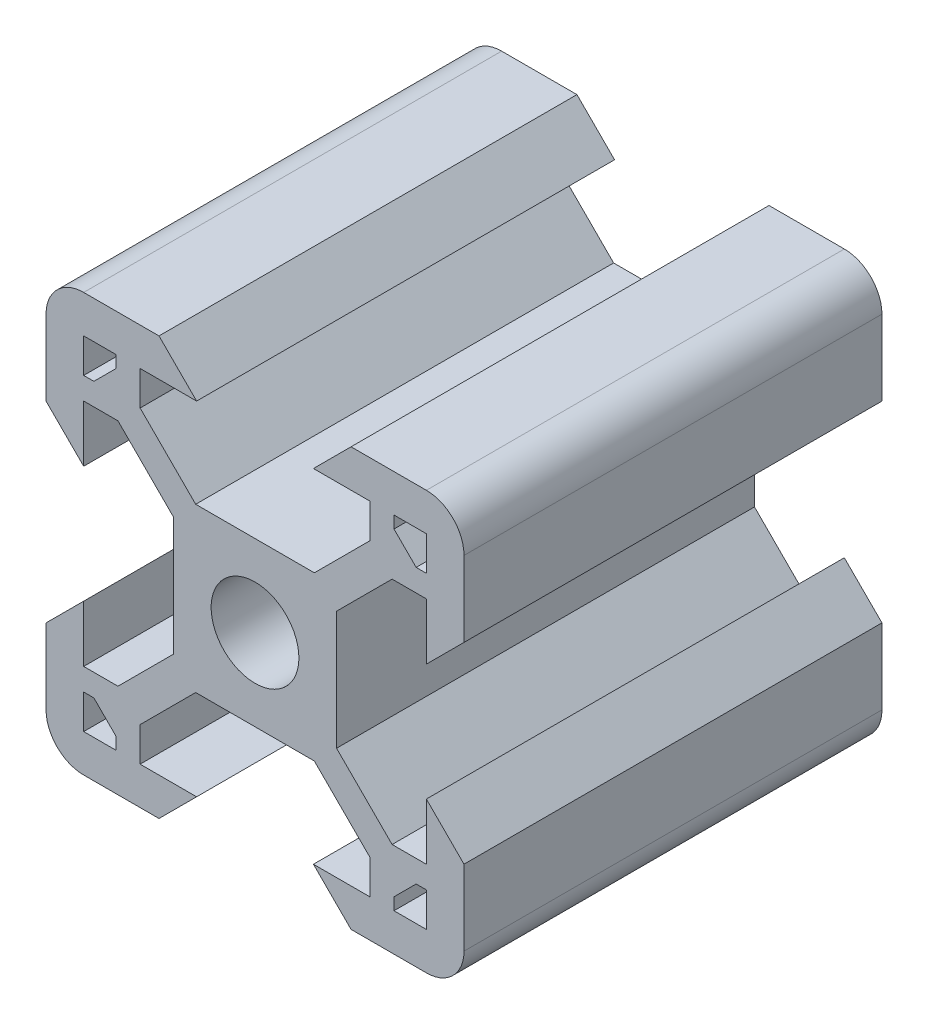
ISO-10303-21;
HEADER;
FILE_DESCRIPTION(('STEP AP214'),'2;1');
FILE_NAME('part.step','',(''),(''),'','','');
FILE_SCHEMA(('AUTOMOTIVE_DESIGN { 1 0 10303 214 1 1 1 1 }'));
ENDSEC;
DATA;
#1=APPLICATION_CONTEXT('core data for automotive mechanical design processes');
#2=APPLICATION_PROTOCOL_DEFINITION('international standard','automotive_design',2000,#1);
#3=PRODUCT_CONTEXT('',#1,'mechanical');
#4=PRODUCT('Part','Part','',(#3));
#5=PRODUCT_RELATED_PRODUCT_CATEGORY('part','',(#4));
#6=PRODUCT_DEFINITION_FORMATION('','',#4);
#7=PRODUCT_DEFINITION_CONTEXT('part definition',#1,'design');
#8=PRODUCT_DEFINITION('design','',#6,#7);
#9=PRODUCT_DEFINITION_SHAPE('','',#8);
#10=(LENGTH_UNIT() NAMED_UNIT(*) SI_UNIT(.MILLI.,.METRE.));
#11=(NAMED_UNIT(*) PLANE_ANGLE_UNIT() SI_UNIT($,.RADIAN.));
#12=(NAMED_UNIT(*) SI_UNIT($,.STERADIAN.) SOLID_ANGLE_UNIT());
#13=UNCERTAINTY_MEASURE_WITH_UNIT(LENGTH_MEASURE(1.E-05),#10,'distance_accuracy_value','');
#14=(GEOMETRIC_REPRESENTATION_CONTEXT(3) GLOBAL_UNCERTAINTY_ASSIGNED_CONTEXT((#13)) GLOBAL_UNIT_ASSIGNED_CONTEXT((#10,
#11,#12)) REPRESENTATION_CONTEXT('',''));
#15=CARTESIAN_POINT('',(0.,0.,0.));
#16=DIRECTION('',(0.,0.,1.));
#17=DIRECTION('',(1.,0.,0.));
#18=AXIS2_PLACEMENT_3D('',#15,#16,#17);
#19=CARTESIAN_POINT('',(8.2,8.2,0.));
#20=DIRECTION('',(0.,1.,0.));
#21=DIRECTION('',(0.707106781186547,0.,0.707106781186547));
#22=AXIS2_PLACEMENT_3D('',#19,#20,#21);
#23=PLANE('',#22);
#24=DIRECTION('',(1.,0.,0.));
#25=VECTOR('',#24,1.);
#26=CARTESIAN_POINT('',(8.2,8.2,20.000214));
#27=LINE('',#26,#25);
#28=CARTESIAN_POINT('',(6.65048164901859,8.2,20.000214));
#29=VERTEX_POINT('',#28);
#30=CARTESIAN_POINT('',(8.2,8.2,20.000214));
#31=VERTEX_POINT('',#30);
#32=EDGE_CURVE('E846',#29,#31,#27,.T.);
#33=ORIENTED_EDGE('',*,*,#32,.F.);
#34=DIRECTION('',(0.,0.,1.));
#35=VECTOR('',#34,1.);
#36=CARTESIAN_POINT('',(6.65048164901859,8.2,0.));
#37=LINE('',#36,#35);
#38=CARTESIAN_POINT('',(6.65048164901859,8.2,0.));
#39=VERTEX_POINT('',#38);
#40=EDGE_CURVE('E45',#39,#29,#37,.T.);
#41=ORIENTED_EDGE('',*,*,#40,.F.);
#42=DIRECTION('',(-1.,0.,0.));
#43=VECTOR('',#42,1.);
#44=CARTESIAN_POINT('',(4.1,8.2,0.));
#45=LINE('',#44,#43);
#46=CARTESIAN_POINT('',(8.2,8.2,0.));
#47=VERTEX_POINT('',#46);
#48=EDGE_CURVE('E751',#47,#39,#45,.T.);
#49=ORIENTED_EDGE('',*,*,#48,.F.);
#50=DIRECTION('',(0.,0.,1.));
#51=VECTOR('',#50,1.);
#52=CARTESIAN_POINT('',(8.2,8.2,0.));
#53=LINE('',#52,#51);
#54=EDGE_CURVE('E11',#47,#31,#53,.T.);
#55=ORIENTED_EDGE('',*,*,#54,.T.);
#56=EDGE_LOOP('',(#33,#41,#49,#55));
#57=FACE_BOUND('',#56,.T.);
#58=ADVANCED_FACE('F36',(#57),#23,.F.);
#59=CARTESIAN_POINT('',(6.65048164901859,8.2,0.));
#60=DIRECTION('',(-1.,0.,0.));
#61=DIRECTION('',(0.,0.707106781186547,0.707106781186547));
#62=AXIS2_PLACEMENT_3D('',#59,#60,#61);
#63=PLANE('',#62);
#64=DIRECTION('',(0.,1.,0.));
#65=VECTOR('',#64,1.);
#66=CARTESIAN_POINT('',(6.65048164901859,8.2,20.000214));
#67=LINE('',#66,#65);
#68=CARTESIAN_POINT('',(6.65048164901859,7.62066017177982,20.000214));
#69=VERTEX_POINT('',#68);
#70=EDGE_CURVE('E848',#69,#29,#67,.T.);
#71=ORIENTED_EDGE('',*,*,#70,.F.);
#72=DIRECTION('',(0.,0.,1.));
#73=VECTOR('',#72,1.);
#74=CARTESIAN_POINT('',(6.65048164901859,7.62066017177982,0.));
#75=LINE('',#74,#73);
#76=CARTESIAN_POINT('',(6.65048164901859,7.62066017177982,0.));
#77=VERTEX_POINT('',#76);
#78=EDGE_CURVE('E733',#77,#69,#75,.T.);
#79=ORIENTED_EDGE('',*,*,#78,.F.);
#80=DIRECTION('',(0.,-1.,0.));
#81=VECTOR('',#80,1.);
#82=CARTESIAN_POINT('',(6.65048164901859,4.1,0.));
#83=LINE('',#82,#81);
#84=EDGE_CURVE('E763',#39,#77,#83,.T.);
#85=ORIENTED_EDGE('',*,*,#84,.F.);
#86=ORIENTED_EDGE('',*,*,#40,.T.);
#87=EDGE_LOOP('',(#71,#79,#85,#86));
#88=FACE_BOUND('',#87,.T.);
#89=ADVANCED_FACE('F1205',(#88),#63,.F.);
#90=CARTESIAN_POINT('',(-6.65048164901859,7.62066017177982,0.));
#91=DIRECTION('',(1.,0.,0.));
#92=DIRECTION('',(0.,0.707106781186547,0.707106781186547));
#93=AXIS2_PLACEMENT_3D('',#90,#91,#92);
#94=PLANE('',#93);
#95=DIRECTION('',(0.,-1.,0.));
#96=VECTOR('',#95,1.);
#97=CARTESIAN_POINT('',(-6.65048164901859,7.62066017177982,20.000214));
#98=LINE('',#97,#96);
#99=CARTESIAN_POINT('',(-6.65048164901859,8.2,20.000214));
#100=VERTEX_POINT('',#99);
#101=CARTESIAN_POINT('',(-6.65048164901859,7.62066017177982,20.000214));
#102=VERTEX_POINT('',#101);
#103=EDGE_CURVE('E855',#100,#102,#98,.T.);
#104=ORIENTED_EDGE('',*,*,#103,.F.);
#105=DIRECTION('',(0.,0.,1.));
#106=VECTOR('',#105,1.);
#107=CARTESIAN_POINT('',(-6.65048164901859,8.2,0.));
#108=LINE('',#107,#106);
#109=CARTESIAN_POINT('',(-6.65048164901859,8.2,0.));
#110=VERTEX_POINT('',#109);
#111=EDGE_CURVE('E824',#110,#100,#108,.T.);
#112=ORIENTED_EDGE('',*,*,#111,.F.);
#113=DIRECTION('',(0.,1.,0.));
#114=VECTOR('',#113,1.);
#115=CARTESIAN_POINT('',(-6.65048164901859,3.81033008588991,0.));
#116=LINE('',#115,#114);
#117=CARTESIAN_POINT('',(-6.65048164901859,7.62066017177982,0.));
#118=VERTEX_POINT('',#117);
#119=EDGE_CURVE('E768',#118,#110,#116,.T.);
#120=ORIENTED_EDGE('',*,*,#119,.F.);
#121=DIRECTION('',(0.,0.,1.));
#122=VECTOR('',#121,1.);
#123=CARTESIAN_POINT('',(-6.65048164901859,7.62066017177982,0.));
#124=LINE('',#123,#122);
#125=EDGE_CURVE('E832',#118,#102,#124,.T.);
#126=ORIENTED_EDGE('',*,*,#125,.T.);
#127=EDGE_LOOP('',(#104,#112,#120,#126));
#128=FACE_BOUND('',#127,.T.);
#129=ADVANCED_FACE('F1211',(#128),#94,.F.);
#130=CARTESIAN_POINT('',(-6.65048164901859,8.2,0.));
#131=DIRECTION('',(0.,1.,0.));
#132=DIRECTION('',(0.707106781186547,0.,0.707106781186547));
#133=AXIS2_PLACEMENT_3D('',#130,#131,#132);
#134=PLANE('',#133);
#135=DIRECTION('',(1.,0.,0.));
#136=VECTOR('',#135,1.);
#137=CARTESIAN_POINT('',(-6.65048164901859,8.2,20.000214));
#138=LINE('',#137,#136);
#139=CARTESIAN_POINT('',(-8.2,8.2,20.000214));
#140=VERTEX_POINT('',#139);
#141=EDGE_CURVE('E857',#140,#100,#138,.T.);
#142=ORIENTED_EDGE('',*,*,#141,.F.);
#143=DIRECTION('',(0.,0.,1.));
#144=VECTOR('',#143,1.);
#145=CARTESIAN_POINT('',(-8.2,8.2,0.));
#146=LINE('',#145,#144);
#147=CARTESIAN_POINT('',(-8.2,8.2,0.));
#148=VERTEX_POINT('',#147);
#149=EDGE_CURVE('E745',#148,#140,#146,.T.);
#150=ORIENTED_EDGE('',*,*,#149,.F.);
#151=DIRECTION('',(-1.,0.,0.));
#152=VECTOR('',#151,1.);
#153=CARTESIAN_POINT('',(-3.32524082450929,8.2,0.));
#154=LINE('',#153,#152);
#155=EDGE_CURVE('E780',#110,#148,#154,.T.);
#156=ORIENTED_EDGE('',*,*,#155,.F.);
#157=ORIENTED_EDGE('',*,*,#111,.T.);
#158=EDGE_LOOP('',(#142,#150,#156,#157));
#159=FACE_BOUND('',#158,.T.);
#160=ADVANCED_FACE('F1219',(#159),#134,.F.);
#161=CARTESIAN_POINT('',(6.65048164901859,-7.62066017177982,0.));
#162=DIRECTION('',(-1.,0.,0.));
#163=DIRECTION('',(0.,0.707106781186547,0.707106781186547));
#164=AXIS2_PLACEMENT_3D('',#161,#162,#163);
#165=PLANE('',#164);
#166=DIRECTION('',(0.,1.,0.));
#167=VECTOR('',#166,1.);
#168=CARTESIAN_POINT('',(6.65048164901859,-7.62066017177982,20.000214));
#169=LINE('',#168,#167);
#170=CARTESIAN_POINT('',(6.65048164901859,-8.2,20.000214));
#171=VERTEX_POINT('',#170);
#172=CARTESIAN_POINT('',(6.65048164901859,-7.62066017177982,20.000214));
#173=VERTEX_POINT('',#172);
#174=EDGE_CURVE('E864',#171,#173,#169,.T.);
#175=ORIENTED_EDGE('',*,*,#174,.F.);
#176=DIRECTION('',(0.,0.,1.));
#177=VECTOR('',#176,1.);
#178=CARTESIAN_POINT('',(6.65048164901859,-8.2,0.));
#179=LINE('',#178,#177);
#180=CARTESIAN_POINT('',(6.65048164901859,-8.2,0.));
#181=VERTEX_POINT('',#180);
#182=EDGE_CURVE('E825',#181,#171,#179,.T.);
#183=ORIENTED_EDGE('',*,*,#182,.F.);
#184=DIRECTION('',(0.,-1.,0.));
#185=VECTOR('',#184,1.);
#186=CARTESIAN_POINT('',(6.65048164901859,-3.81033008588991,0.));
#187=LINE('',#186,#185);
#188=CARTESIAN_POINT('',(6.65048164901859,-7.62066017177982,0.));
#189=VERTEX_POINT('',#188);
#190=EDGE_CURVE('E785',#189,#181,#187,.T.);
#191=ORIENTED_EDGE('',*,*,#190,.F.);
#192=DIRECTION('',(0.,0.,1.));
#193=VECTOR('',#192,1.);
#194=CARTESIAN_POINT('',(6.65048164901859,-7.62066017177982,0.));
#195=LINE('',#194,#193);
#196=EDGE_CURVE('E821',#189,#173,#195,.T.);
#197=ORIENTED_EDGE('',*,*,#196,.T.);
#198=EDGE_LOOP('',(#175,#183,#191,#197));
#199=FACE_BOUND('',#198,.T.);
#200=ADVANCED_FACE('F1223',(#199),#165,.F.);
#201=CARTESIAN_POINT('',(6.65048164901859,-8.2,0.));
#202=DIRECTION('',(0.,-1.,0.));
#203=DIRECTION('',(0.707106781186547,0.,0.707106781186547));
#204=AXIS2_PLACEMENT_3D('',#201,#202,#203);
#205=PLANE('',#204);
#206=DIRECTION('',(-1.,0.,0.));
#207=VECTOR('',#206,1.);
#208=CARTESIAN_POINT('',(6.65048164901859,-8.2,20.000214));
#209=LINE('',#208,#207);
#210=CARTESIAN_POINT('',(8.2,-8.2,20.000214));
#211=VERTEX_POINT('',#210);
#212=EDGE_CURVE('E866',#211,#171,#209,.T.);
#213=ORIENTED_EDGE('',*,*,#212,.F.);
#214=DIRECTION('',(0.,0.,1.));
#215=VECTOR('',#214,1.);
#216=CARTESIAN_POINT('',(8.2,-8.2,0.));
#217=LINE('',#216,#215);
#218=CARTESIAN_POINT('',(8.2,-8.2,0.));
#219=VERTEX_POINT('',#218);
#220=EDGE_CURVE('E760',#219,#211,#217,.T.);
#221=ORIENTED_EDGE('',*,*,#220,.F.);
#222=DIRECTION('',(1.,0.,0.));
#223=VECTOR('',#222,1.);
#224=CARTESIAN_POINT('',(3.32524082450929,-8.2,0.));
#225=LINE('',#224,#223);
#226=EDGE_CURVE('E795',#181,#219,#225,.T.);
#227=ORIENTED_EDGE('',*,*,#226,.F.);
#228=ORIENTED_EDGE('',*,*,#182,.T.);
#229=EDGE_LOOP('',(#213,#221,#227,#228));
#230=FACE_BOUND('',#229,.T.);
#231=ADVANCED_FACE('F1227',(#230),#205,.F.);
#232=CARTESIAN_POINT('',(-8.2,-8.2,0.));
#233=DIRECTION('',(0.,-1.,0.));
#234=DIRECTION('',(0.707106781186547,0.,0.707106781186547));
#235=AXIS2_PLACEMENT_3D('',#232,#233,#234);
#236=PLANE('',#235);
#237=DIRECTION('',(-1.,0.,0.));
#238=VECTOR('',#237,1.);
#239=CARTESIAN_POINT('',(-8.2,-8.2,20.000214));
#240=LINE('',#239,#238);
#241=CARTESIAN_POINT('',(-6.65048164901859,-8.2,20.000214));
#242=VERTEX_POINT('',#241);
#243=CARTESIAN_POINT('',(-8.2,-8.2,20.000214));
#244=VERTEX_POINT('',#243);
#245=EDGE_CURVE('E874',#242,#244,#240,.T.);
#246=ORIENTED_EDGE('',*,*,#245,.F.);
#247=DIRECTION('',(0.,0.,1.));
#248=VECTOR('',#247,1.);
#249=CARTESIAN_POINT('',(-6.65048164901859,-8.2,0.));
#250=LINE('',#249,#248);
#251=CARTESIAN_POINT('',(-6.65048164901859,-8.2,0.));
#252=VERTEX_POINT('',#251);
#253=EDGE_CURVE('E626',#252,#242,#250,.T.);
#254=ORIENTED_EDGE('',*,*,#253,.F.);
#255=DIRECTION('',(1.,0.,0.));
#256=VECTOR('',#255,1.);
#257=CARTESIAN_POINT('',(-4.1,-8.2,0.));
#258=LINE('',#257,#256);
#259=CARTESIAN_POINT('',(-8.2,-8.2,0.));
#260=VERTEX_POINT('',#259);
#261=EDGE_CURVE('E798',#260,#252,#258,.T.);
#262=ORIENTED_EDGE('',*,*,#261,.F.);
#263=DIRECTION('',(0.,0.,1.));
#264=VECTOR('',#263,1.);
#265=CARTESIAN_POINT('',(-8.2,-8.2,0.));
#266=LINE('',#265,#264);
#267=EDGE_CURVE('E810',#260,#244,#266,.T.);
#268=ORIENTED_EDGE('',*,*,#267,.T.);
#269=EDGE_LOOP('',(#246,#254,#262,#268));
#270=FACE_BOUND('',#269,.T.);
#271=ADVANCED_FACE('F1231',(#270),#236,.F.);
#272=CARTESIAN_POINT('',(-6.65048164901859,-8.2,0.));
#273=DIRECTION('',(1.,0.,0.));
#274=DIRECTION('',(0.,0.707106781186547,0.707106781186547));
#275=AXIS2_PLACEMENT_3D('',#272,#273,#274);
#276=PLANE('',#275);
#277=DIRECTION('',(0.,-1.,0.));
#278=VECTOR('',#277,1.);
#279=CARTESIAN_POINT('',(-6.65048164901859,-8.2,20.000214));
#280=LINE('',#279,#278);
#281=CARTESIAN_POINT('',(-6.65048164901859,-7.62066017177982,20.000214));
#282=VERTEX_POINT('',#281);
#283=EDGE_CURVE('E876',#282,#242,#280,.T.);
#284=ORIENTED_EDGE('',*,*,#283,.F.);
#285=DIRECTION('',(0.,0.,1.));
#286=VECTOR('',#285,1.);
#287=CARTESIAN_POINT('',(-6.65048164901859,-7.62066017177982,0.));
#288=LINE('',#287,#286);
#289=CARTESIAN_POINT('',(-6.65048164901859,-7.62066017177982,0.));
#290=VERTEX_POINT('',#289);
#291=EDGE_CURVE('E777',#290,#282,#288,.T.);
#292=ORIENTED_EDGE('',*,*,#291,.F.);
#293=DIRECTION('',(0.,1.,0.));
#294=VECTOR('',#293,1.);
#295=CARTESIAN_POINT('',(-6.65048164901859,-4.1,0.));
#296=LINE('',#295,#294);
#297=EDGE_CURVE('E502',#252,#290,#296,.T.);
#298=ORIENTED_EDGE('',*,*,#297,.F.);
#299=ORIENTED_EDGE('',*,*,#253,.T.);
#300=EDGE_LOOP('',(#284,#292,#298,#299));
#301=FACE_BOUND('',#300,.T.);
#302=ADVANCED_FACE('F1235',(#301),#276,.F.);
#303=CARTESIAN_POINT('',(5.49933982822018,8.2,0.));
#304=DIRECTION('',(-1.,0.,0.));
#305=DIRECTION('',(0.,0.707106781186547,0.707106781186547));
#306=AXIS2_PLACEMENT_3D('',#303,#304,#305);
#307=PLANE('',#306);
#308=DIRECTION('',(0.,0.,1.));
#309=VECTOR('',#308,1.);
#310=CARTESIAN_POINT('',(5.49933982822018,6.56,0.));
#311=LINE('',#310,#309);
#312=CARTESIAN_POINT('',(5.49933982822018,6.56,0.));
#313=VERTEX_POINT('',#312);
#314=CARTESIAN_POINT('',(5.49933982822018,6.56,20.000214));
#315=VERTEX_POINT('',#314);
#316=EDGE_CURVE('E623',#313,#315,#311,.T.);
#317=ORIENTED_EDGE('',*,*,#316,.T.);
#318=DIRECTION('',(0.,-1.,0.));
#319=VECTOR('',#318,1.);
#320=CARTESIAN_POINT('',(5.49933982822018,8.2,20.000214));
#321=LINE('',#320,#319);
#322=CARTESIAN_POINT('',(5.49933982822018,8.2,20.000214));
#323=VERTEX_POINT('',#322);
#324=EDGE_CURVE('E927',#323,#315,#321,.T.);
#325=ORIENTED_EDGE('',*,*,#324,.F.);
#326=DIRECTION('',(0.,0.,1.));
#327=VECTOR('',#326,1.);
#328=CARTESIAN_POINT('',(5.49933982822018,8.2,0.));
#329=LINE('',#328,#327);
#330=CARTESIAN_POINT('',(5.49933982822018,8.2,0.));
#331=VERTEX_POINT('',#330);
#332=EDGE_CURVE('E621',#331,#323,#329,.T.);
#333=ORIENTED_EDGE('',*,*,#332,.F.);
#334=DIRECTION('',(0.,1.,0.));
#335=VECTOR('',#334,1.);
#336=CARTESIAN_POINT('',(5.49933982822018,4.1,0.));
#337=LINE('',#336,#335);
#338=EDGE_CURVE('E612',#313,#331,#337,.T.);
#339=ORIENTED_EDGE('',*,*,#338,.F.);
#340=EDGE_LOOP('',(#317,#325,#333,#339));
#341=FACE_BOUND('',#340,.T.);
#342=ADVANCED_FACE('F1090',(#341),#307,.T.);
#343=CARTESIAN_POINT('',(2.79514604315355,8.2,0.));
#344=DIRECTION('',(0.,-1.,0.));
#345=DIRECTION('',(0.707106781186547,0.,0.707106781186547));
#346=AXIS2_PLACEMENT_3D('',#343,#344,#345);
#347=PLANE('',#346);
#348=ORIENTED_EDGE('',*,*,#332,.T.);
#349=DIRECTION('',(1.,0.,0.));
#350=VECTOR('',#349,1.);
#351=CARTESIAN_POINT('',(2.79514604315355,8.2,20.000214));
#352=LINE('',#351,#350);
#353=CARTESIAN_POINT('',(2.79514604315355,8.2,20.000214));
#354=VERTEX_POINT('',#353);
#355=EDGE_CURVE('E929',#354,#323,#352,.T.);
#356=ORIENTED_EDGE('',*,*,#355,.F.);
#357=DIRECTION('',(0.,0.,1.));
#358=VECTOR('',#357,1.);
#359=CARTESIAN_POINT('',(2.79514604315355,8.2,0.));
#360=LINE('',#359,#358);
#361=CARTESIAN_POINT('',(2.79514604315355,8.2,0.));
#362=VERTEX_POINT('',#361);
#363=EDGE_CURVE('E627',#362,#354,#360,.T.);
#364=ORIENTED_EDGE('',*,*,#363,.F.);
#365=DIRECTION('',(-1.,0.,0.));
#366=VECTOR('',#365,1.);
#367=CARTESIAN_POINT('',(1.39757302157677,8.2,0.));
#368=LINE('',#367,#366);
#369=EDGE_CURVE('E614',#331,#362,#368,.T.);
#370=ORIENTED_EDGE('',*,*,#369,.F.);
#371=EDGE_LOOP('',(#348,#356,#364,#370));
#372=FACE_BOUND('',#371,.T.);
#373=ADVANCED_FACE('F1086',(#372),#347,.T.);
#374=CARTESIAN_POINT('',(4.59514604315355,10.,0.));
#375=DIRECTION('',(-0.707106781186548,0.707106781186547,0.));
#376=DIRECTION('',(0.577350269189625,0.577350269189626,0.577350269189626));
#377=AXIS2_PLACEMENT_3D('',#374,#375,#376);
#378=PLANE('',#377);
#379=ORIENTED_EDGE('',*,*,#363,.T.);
#380=DIRECTION('',(-0.707106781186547,-0.707106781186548,0.));
#381=VECTOR('',#380,1.);
#382=CARTESIAN_POINT('',(4.59514604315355,10.,20.000214));
#383=LINE('',#382,#381);
#384=CARTESIAN_POINT('',(4.59514604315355,10.,20.000214));
#385=VERTEX_POINT('',#384);
#386=EDGE_CURVE('E931',#385,#354,#383,.T.);
#387=ORIENTED_EDGE('',*,*,#386,.F.);
#388=DIRECTION('',(0.,0.,1.));
#389=VECTOR('',#388,1.);
#390=CARTESIAN_POINT('',(4.59514604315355,10.,0.));
#391=LINE('',#390,#389);
#392=CARTESIAN_POINT('',(4.59514604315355,10.,0.));
#393=VERTEX_POINT('',#392);
#394=EDGE_CURVE('E629',#393,#385,#391,.T.);
#395=ORIENTED_EDGE('',*,*,#394,.F.);
#396=DIRECTION('',(0.707106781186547,0.707106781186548,0.));
#397=VECTOR('',#396,1.);
#398=CARTESIAN_POINT('',(0.946359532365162,6.35121348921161,0.));
#399=LINE('',#398,#397);
#400=EDGE_CURVE('E617',#362,#393,#399,.T.);
#401=ORIENTED_EDGE('',*,*,#400,.F.);
#402=EDGE_LOOP('',(#379,#387,#395,#401));
#403=FACE_BOUND('',#402,.T.);
#404=ADVANCED_FACE('F1080',(#403),#378,.T.);
#405=CARTESIAN_POINT('',(8.2,10.,0.));
#406=DIRECTION('',(0.,1.,0.));
#407=DIRECTION('',(0.707106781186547,0.,0.707106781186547));
#408=AXIS2_PLACEMENT_3D('',#405,#406,#407);
#409=PLANE('',#408);
#410=ORIENTED_EDGE('',*,*,#394,.T.);
#411=DIRECTION('',(-1.,0.,0.));
#412=VECTOR('',#411,1.);
#413=CARTESIAN_POINT('',(8.2,10.,20.000214));
#414=LINE('',#413,#412);
#415=CARTESIAN_POINT('',(8.2,10.,20.000214));
#416=VERTEX_POINT('',#415);
#417=EDGE_CURVE('E933',#416,#385,#414,.T.);
#418=ORIENTED_EDGE('',*,*,#417,.F.);
#419=DIRECTION('',(0.,0.,1.));
#420=VECTOR('',#419,1.);
#421=CARTESIAN_POINT('',(8.2,10.,0.));
#422=LINE('',#421,#420);
#423=CARTESIAN_POINT('',(8.2,10.,0.));
#424=VERTEX_POINT('',#423);
#425=EDGE_CURVE('E633',#424,#416,#422,.T.);
#426=ORIENTED_EDGE('',*,*,#425,.F.);
#427=DIRECTION('',(1.,0.,0.));
#428=VECTOR('',#427,1.);
#429=CARTESIAN_POINT('',(4.1,10.,0.));
#430=LINE('',#429,#428);
#431=EDGE_CURVE('E635',#393,#424,#430,.T.);
#432=ORIENTED_EDGE('',*,*,#431,.F.);
#433=EDGE_LOOP('',(#410,#418,#426,#432));
#434=FACE_BOUND('',#433,.T.);
#435=ADVANCED_FACE('F1075',(#434),#409,.T.);
#436=CARTESIAN_POINT('',(8.2,8.2,0.));
#437=DIRECTION('',(0.,0.,1.));
#438=DIRECTION('',(1.,0.,0.));
#439=AXIS2_PLACEMENT_3D('',#436,#437,#438);
#440=CYLINDRICAL_SURFACE('',#439,1.8);
#441=ORIENTED_EDGE('',*,*,#425,.T.);
#442=CARTESIAN_POINT('',(8.2,8.2,20.000214));
#443=DIRECTION('',(0.,0.,1.));
#444=DIRECTION('',(1.,0.,0.));
#445=AXIS2_PLACEMENT_3D('',#442,#443,#444);
#446=CIRCLE('',#445,1.8);
#447=CARTESIAN_POINT('',(10.,8.2,20.000214));
#448=VERTEX_POINT('',#447);
#449=EDGE_CURVE('E935',#448,#416,#446,.T.);
#450=ORIENTED_EDGE('',*,*,#449,.F.);
#451=DIRECTION('',(0.,0.,1.));
#452=VECTOR('',#451,1.);
#453=CARTESIAN_POINT('',(10.,8.2,0.));
#454=LINE('',#453,#452);
#455=CARTESIAN_POINT('',(10.,8.2,0.));
#456=VERTEX_POINT('',#455);
#457=EDGE_CURVE('E638',#456,#448,#454,.T.);
#458=ORIENTED_EDGE('',*,*,#457,.F.);
#459=CARTESIAN_POINT('',(8.2,8.2,0.));
#460=DIRECTION('',(0.,0.,-1.));
#461=DIRECTION('',(1.,0.,0.));
#462=AXIS2_PLACEMENT_3D('',#459,#460,#461);
#463=CIRCLE('',#462,1.8);
#464=EDGE_CURVE('E640',#424,#456,#463,.T.);
#465=ORIENTED_EDGE('',*,*,#464,.F.);
#466=EDGE_LOOP('',(#441,#450,#458,#465));
#467=FACE_BOUND('',#466,.T.);
#468=ADVANCED_FACE('F1070',(#467),#440,.T.);
#469=CARTESIAN_POINT('',(10.,4.59514604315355,0.));
#470=DIRECTION('',(1.,0.,0.));
#471=DIRECTION('',(0.,0.707106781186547,0.707106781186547));
#472=AXIS2_PLACEMENT_3D('',#469,#470,#471);
#473=PLANE('',#472);
#474=ORIENTED_EDGE('',*,*,#457,.T.);
#475=DIRECTION('',(0.,1.,0.));
#476=VECTOR('',#475,1.);
#477=CARTESIAN_POINT('',(10.,4.59514604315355,20.000214));
#478=LINE('',#477,#476);
#479=CARTESIAN_POINT('',(10.,4.59514604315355,20.000214));
#480=VERTEX_POINT('',#479);
#481=EDGE_CURVE('E937',#480,#448,#478,.T.);
#482=ORIENTED_EDGE('',*,*,#481,.F.);
#483=DIRECTION('',(0.,0.,1.));
#484=VECTOR('',#483,1.);
#485=CARTESIAN_POINT('',(10.,4.59514604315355,0.));
#486=LINE('',#485,#484);
#487=CARTESIAN_POINT('',(10.,4.59514604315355,0.));
#488=VERTEX_POINT('',#487);
#489=EDGE_CURVE('E643',#488,#480,#486,.T.);
#490=ORIENTED_EDGE('',*,*,#489,.F.);
#491=DIRECTION('',(0.,-1.,0.));
#492=VECTOR('',#491,1.);
#493=CARTESIAN_POINT('',(10.,2.29757302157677,0.));
#494=LINE('',#493,#492);
#495=EDGE_CURVE('E645',#456,#488,#494,.T.);
#496=ORIENTED_EDGE('',*,*,#495,.F.);
#497=EDGE_LOOP('',(#474,#482,#490,#496));
#498=FACE_BOUND('',#497,.T.);
#499=ADVANCED_FACE('F1065',(#498),#473,.T.);
#500=CARTESIAN_POINT('',(8.2,2.79514604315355,0.));
#501=DIRECTION('',(0.707106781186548,-0.707106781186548,0.));
#502=DIRECTION('',(0.577350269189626,0.577350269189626,0.577350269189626));
#503=AXIS2_PLACEMENT_3D('',#500,#501,#502);
#504=PLANE('',#503);
#505=ORIENTED_EDGE('',*,*,#489,.T.);
#506=DIRECTION('',(0.707106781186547,0.707106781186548,0.));
#507=VECTOR('',#506,1.);
#508=CARTESIAN_POINT('',(8.2,2.79514604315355,20.000214));
#509=LINE('',#508,#507);
#510=CARTESIAN_POINT('',(8.2,2.79514604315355,20.000214));
#511=VERTEX_POINT('',#510);
#512=EDGE_CURVE('E939',#511,#480,#509,.T.);
#513=ORIENTED_EDGE('',*,*,#512,.F.);
#514=DIRECTION('',(0.,0.,1.));
#515=VECTOR('',#514,1.);
#516=CARTESIAN_POINT('',(8.2,2.79514604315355,0.));
#517=LINE('',#516,#515);
#518=CARTESIAN_POINT('',(8.2,2.79514604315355,0.));
#519=VERTEX_POINT('',#518);
#520=EDGE_CURVE('E648',#519,#511,#517,.T.);
#521=ORIENTED_EDGE('',*,*,#520,.F.);
#522=DIRECTION('',(-0.707106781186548,-0.707106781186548,0.));
#523=VECTOR('',#522,1.);
#524=CARTESIAN_POINT('',(5.45121348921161,0.0463595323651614,0.));
#525=LINE('',#524,#523);
#526=EDGE_CURVE('E650',#488,#519,#525,.T.);
#527=ORIENTED_EDGE('',*,*,#526,.F.);
#528=EDGE_LOOP('',(#505,#513,#521,#527));
#529=FACE_BOUND('',#528,.T.);
#530=ADVANCED_FACE('F1060',(#529),#504,.T.);
#531=CARTESIAN_POINT('',(8.2,5.49933982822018,0.));
#532=DIRECTION('',(-1.,0.,0.));
#533=DIRECTION('',(0.,0.707106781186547,0.707106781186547));
#534=AXIS2_PLACEMENT_3D('',#531,#532,#533);
#535=PLANE('',#534);
#536=ORIENTED_EDGE('',*,*,#520,.T.);
#537=DIRECTION('',(0.,-1.,0.));
#538=VECTOR('',#537,1.);
#539=CARTESIAN_POINT('',(8.2,5.49933982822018,20.000214));
#540=LINE('',#539,#538);
#541=CARTESIAN_POINT('',(8.2,5.49933982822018,20.000214));
#542=VERTEX_POINT('',#541);
#543=EDGE_CURVE('E941',#542,#511,#540,.T.);
#544=ORIENTED_EDGE('',*,*,#543,.F.);
#545=DIRECTION('',(0.,0.,1.));
#546=VECTOR('',#545,1.);
#547=CARTESIAN_POINT('',(8.2,5.49933982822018,0.));
#548=LINE('',#547,#546);
#549=CARTESIAN_POINT('',(8.2,5.49933982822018,0.));
#550=VERTEX_POINT('',#549);
#551=EDGE_CURVE('E653',#550,#542,#548,.T.);
#552=ORIENTED_EDGE('',*,*,#551,.F.);
#553=DIRECTION('',(0.,1.,0.));
#554=VECTOR('',#553,1.);
#555=CARTESIAN_POINT('',(8.2,2.74966991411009,0.));
#556=LINE('',#555,#554);
#557=EDGE_CURVE('E655',#519,#550,#556,.T.);
#558=ORIENTED_EDGE('',*,*,#557,.F.);
#559=EDGE_LOOP('',(#536,#544,#552,#558));
#560=FACE_BOUND('',#559,.T.);
#561=ADVANCED_FACE('F1055',(#560),#535,.T.);
#562=CARTESIAN_POINT('',(6.56,5.49933982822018,0.));
#563=DIRECTION('',(0.,-1.,0.));
#564=DIRECTION('',(0.707106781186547,0.,0.707106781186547));
#565=AXIS2_PLACEMENT_3D('',#562,#563,#564);
#566=PLANE('',#565);
#567=ORIENTED_EDGE('',*,*,#551,.T.);
#568=DIRECTION('',(1.,0.,0.));
#569=VECTOR('',#568,1.);
#570=CARTESIAN_POINT('',(6.56,5.49933982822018,20.000214));
#571=LINE('',#570,#569);
#572=CARTESIAN_POINT('',(6.56,5.49933982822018,20.000214));
#573=VERTEX_POINT('',#572);
#574=EDGE_CURVE('E943',#573,#542,#571,.T.);
#575=ORIENTED_EDGE('',*,*,#574,.F.);
#576=DIRECTION('',(0.,0.,1.));
#577=VECTOR('',#576,1.);
#578=CARTESIAN_POINT('',(6.56,5.49933982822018,0.));
#579=LINE('',#578,#577);
#580=CARTESIAN_POINT('',(6.56,5.49933982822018,0.));
#581=VERTEX_POINT('',#580);
#582=EDGE_CURVE('E658',#581,#573,#579,.T.);
#583=ORIENTED_EDGE('',*,*,#582,.F.);
#584=DIRECTION('',(-1.,0.,0.));
#585=VECTOR('',#584,1.);
#586=CARTESIAN_POINT('',(3.28,5.49933982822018,0.));
#587=LINE('',#586,#585);
#588=EDGE_CURVE('E660',#550,#581,#587,.T.);
#589=ORIENTED_EDGE('',*,*,#588,.F.);
#590=EDGE_LOOP('',(#567,#575,#583,#589));
#591=FACE_BOUND('',#590,.T.);
#592=ADVANCED_FACE('F1050',(#591),#566,.T.);
#593=CARTESIAN_POINT('',(3.90066017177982,2.84,0.));
#594=DIRECTION('',(0.707106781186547,-0.707106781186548,0.));
#595=DIRECTION('',(0.577350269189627,0.577350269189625,0.577350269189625));
#596=AXIS2_PLACEMENT_3D('',#593,#594,#595);
#597=PLANE('',#596);
#598=ORIENTED_EDGE('',*,*,#582,.T.);
#599=DIRECTION('',(0.707106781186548,0.707106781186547,0.));
#600=VECTOR('',#599,1.);
#601=CARTESIAN_POINT('',(3.90066017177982,2.84,20.000214));
#602=LINE('',#601,#600);
#603=CARTESIAN_POINT('',(3.90066017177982,2.84,20.000214));
#604=VERTEX_POINT('',#603);
#605=EDGE_CURVE('E945',#604,#573,#602,.T.);
#606=ORIENTED_EDGE('',*,*,#605,.F.);
#607=DIRECTION('',(0.,0.,1.));
#608=VECTOR('',#607,1.);
#609=CARTESIAN_POINT('',(3.90066017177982,2.84,0.));
#610=LINE('',#609,#608);
#611=CARTESIAN_POINT('',(3.90066017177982,2.84,0.));
#612=VERTEX_POINT('',#611);
#613=EDGE_CURVE('E663',#612,#604,#610,.T.);
#614=ORIENTED_EDGE('',*,*,#613,.F.);
#615=DIRECTION('',(-0.707106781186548,-0.707106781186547,0.));
#616=VECTOR('',#615,1.);
#617=CARTESIAN_POINT('',(2.21549512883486,1.15483495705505,0.));
#618=LINE('',#617,#616);
#619=EDGE_CURVE('E665',#581,#612,#618,.T.);
#620=ORIENTED_EDGE('',*,*,#619,.F.);
#621=EDGE_LOOP('',(#598,#606,#614,#620));
#622=FACE_BOUND('',#621,.T.);
#623=ADVANCED_FACE('F1045',(#622),#597,.T.);
#624=CARTESIAN_POINT('',(3.90066017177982,-2.84,0.));
#625=DIRECTION('',(1.,0.,0.));
#626=DIRECTION('',(0.,0.707106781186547,0.707106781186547));
#627=AXIS2_PLACEMENT_3D('',#624,#625,#626);
#628=PLANE('',#627);
#629=ORIENTED_EDGE('',*,*,#613,.T.);
#630=DIRECTION('',(0.,1.,0.));
#631=VECTOR('',#630,1.);
#632=CARTESIAN_POINT('',(3.90066017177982,-2.84,20.000214));
#633=LINE('',#632,#631);
#634=CARTESIAN_POINT('',(3.90066017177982,-2.84,20.000214));
#635=VERTEX_POINT('',#634);
#636=EDGE_CURVE('E947',#635,#604,#633,.T.);
#637=ORIENTED_EDGE('',*,*,#636,.F.);
#638=DIRECTION('',(0.,0.,1.));
#639=VECTOR('',#638,1.);
#640=CARTESIAN_POINT('',(3.90066017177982,-2.84,0.));
#641=LINE('',#640,#639);
#642=CARTESIAN_POINT('',(3.90066017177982,-2.84,0.));
#643=VERTEX_POINT('',#642);
#644=EDGE_CURVE('E668',#643,#635,#641,.T.);
#645=ORIENTED_EDGE('',*,*,#644,.F.);
#646=DIRECTION('',(0.,-1.,0.));
#647=VECTOR('',#646,1.);
#648=CARTESIAN_POINT('',(3.90066017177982,-1.42,0.));
#649=LINE('',#648,#647);
#650=EDGE_CURVE('E670',#612,#643,#649,.T.);
#651=ORIENTED_EDGE('',*,*,#650,.F.);
#652=EDGE_LOOP('',(#629,#637,#645,#651));
#653=FACE_BOUND('',#652,.T.);
#654=ADVANCED_FACE('F1040',(#653),#628,.T.);
#655=CARTESIAN_POINT('',(6.56,-5.49933982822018,0.));
#656=DIRECTION('',(0.707106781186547,0.707106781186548,0.));
#657=DIRECTION('',(-0.577350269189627,0.577350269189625,0.577350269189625));
#658=AXIS2_PLACEMENT_3D('',#655,#656,#657);
#659=PLANE('',#658);
#660=ORIENTED_EDGE('',*,*,#644,.T.);
#661=DIRECTION('',(-0.707106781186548,0.707106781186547,0.));
#662=VECTOR('',#661,1.);
#663=CARTESIAN_POINT('',(6.56,-5.49933982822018,20.000214));
#664=LINE('',#663,#662);
#665=CARTESIAN_POINT('',(6.56,-5.49933982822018,20.000214));
#666=VERTEX_POINT('',#665);
#667=EDGE_CURVE('E949',#666,#635,#664,.T.);
#668=ORIENTED_EDGE('',*,*,#667,.F.);
#669=DIRECTION('',(0.,0.,1.));
#670=VECTOR('',#669,1.);
#671=CARTESIAN_POINT('',(6.56,-5.49933982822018,0.));
#672=LINE('',#671,#670);
#673=CARTESIAN_POINT('',(6.56,-5.49933982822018,0.));
#674=VERTEX_POINT('',#673);
#675=EDGE_CURVE('E673',#674,#666,#672,.T.);
#676=ORIENTED_EDGE('',*,*,#675,.F.);
#677=DIRECTION('',(0.707106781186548,-0.707106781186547,0.));
#678=VECTOR('',#677,1.);
#679=CARTESIAN_POINT('',(3.54516504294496,-2.48450487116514,0.));
#680=LINE('',#679,#678);
#681=EDGE_CURVE('E675',#643,#674,#680,.T.);
#682=ORIENTED_EDGE('',*,*,#681,.F.);
#683=EDGE_LOOP('',(#660,#668,#676,#682));
#684=FACE_BOUND('',#683,.T.);
#685=ADVANCED_FACE('F1035',(#684),#659,.T.);
#686=CARTESIAN_POINT('',(8.2,-5.49933982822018,0.));
#687=DIRECTION('',(0.,1.,0.));
#688=DIRECTION('',(0.707106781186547,0.,0.707106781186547));
#689=AXIS2_PLACEMENT_3D('',#686,#687,#688);
#690=PLANE('',#689);
#691=ORIENTED_EDGE('',*,*,#675,.T.);
#692=DIRECTION('',(-1.,0.,0.));
#693=VECTOR('',#692,1.);
#694=CARTESIAN_POINT('',(8.2,-5.49933982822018,20.000214));
#695=LINE('',#694,#693);
#696=CARTESIAN_POINT('',(8.2,-5.49933982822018,20.000214));
#697=VERTEX_POINT('',#696);
#698=EDGE_CURVE('E951',#697,#666,#695,.T.);
#699=ORIENTED_EDGE('',*,*,#698,.F.);
#700=DIRECTION('',(0.,0.,1.));
#701=VECTOR('',#700,1.);
#702=CARTESIAN_POINT('',(8.2,-5.49933982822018,0.));
#703=LINE('',#702,#701);
#704=CARTESIAN_POINT('',(8.2,-5.49933982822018,0.));
#705=VERTEX_POINT('',#704);
#706=EDGE_CURVE('E678',#705,#697,#703,.T.);
#707=ORIENTED_EDGE('',*,*,#706,.F.);
#708=DIRECTION('',(1.,0.,0.));
#709=VECTOR('',#708,1.);
#710=CARTESIAN_POINT('',(4.1,-5.49933982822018,0.));
#711=LINE('',#710,#709);
#712=EDGE_CURVE('E680',#674,#705,#711,.T.);
#713=ORIENTED_EDGE('',*,*,#712,.F.);
#714=EDGE_LOOP('',(#691,#699,#707,#713));
#715=FACE_BOUND('',#714,.T.);
#716=ADVANCED_FACE('F1030',(#715),#690,.T.);
#717=CARTESIAN_POINT('',(8.2,-2.79514604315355,0.));
#718=DIRECTION('',(-1.,0.,0.));
#719=DIRECTION('',(0.,0.707106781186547,0.707106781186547));
#720=AXIS2_PLACEMENT_3D('',#717,#718,#719);
#721=PLANE('',#720);
#722=ORIENTED_EDGE('',*,*,#706,.T.);
#723=DIRECTION('',(0.,-1.,0.));
#724=VECTOR('',#723,1.);
#725=CARTESIAN_POINT('',(8.2,-2.79514604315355,20.000214));
#726=LINE('',#725,#724);
#727=CARTESIAN_POINT('',(8.2,-2.79514604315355,20.000214));
#728=VERTEX_POINT('',#727);
#729=EDGE_CURVE('E953',#728,#697,#726,.T.);
#730=ORIENTED_EDGE('',*,*,#729,.F.);
#731=DIRECTION('',(0.,0.,1.));
#732=VECTOR('',#731,1.);
#733=CARTESIAN_POINT('',(8.2,-2.79514604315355,0.));
#734=LINE('',#733,#732);
#735=CARTESIAN_POINT('',(8.2,-2.79514604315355,0.));
#736=VERTEX_POINT('',#735);
#737=EDGE_CURVE('E683',#736,#728,#734,.T.);
#738=ORIENTED_EDGE('',*,*,#737,.F.);
#739=DIRECTION('',(0.,1.,0.));
#740=VECTOR('',#739,1.);
#741=CARTESIAN_POINT('',(8.2,-1.39757302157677,0.));
#742=LINE('',#741,#740);
#743=EDGE_CURVE('E685',#705,#736,#742,.T.);
#744=ORIENTED_EDGE('',*,*,#743,.F.);
#745=EDGE_LOOP('',(#722,#730,#738,#744));
#746=FACE_BOUND('',#745,.T.);
#747=ADVANCED_FACE('F1025',(#746),#721,.T.);
#748=CARTESIAN_POINT('',(10.,-4.59514604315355,0.));
#749=DIRECTION('',(0.707106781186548,0.707106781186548,0.));
#750=DIRECTION('',(-0.577350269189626,0.577350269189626,0.577350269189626));
#751=AXIS2_PLACEMENT_3D('',#748,#749,#750);
#752=PLANE('',#751);
#753=ORIENTED_EDGE('',*,*,#737,.T.);
#754=DIRECTION('',(-0.707106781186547,0.707106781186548,0.));
#755=VECTOR('',#754,1.);
#756=CARTESIAN_POINT('',(10.,-4.59514604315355,20.000214));
#757=LINE('',#756,#755);
#758=CARTESIAN_POINT('',(10.,-4.59514604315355,20.000214));
#759=VERTEX_POINT('',#758);
#760=EDGE_CURVE('E955',#759,#728,#757,.T.);
#761=ORIENTED_EDGE('',*,*,#760,.F.);
#762=DIRECTION('',(0.,0.,1.));
#763=VECTOR('',#762,1.);
#764=CARTESIAN_POINT('',(10.,-4.59514604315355,0.));
#765=LINE('',#764,#763);
#766=CARTESIAN_POINT('',(10.,-4.59514604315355,0.));
#767=VERTEX_POINT('',#766);
#768=EDGE_CURVE('E688',#767,#759,#765,.T.);
#769=ORIENTED_EDGE('',*,*,#768,.F.);
#770=DIRECTION('',(0.707106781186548,-0.707106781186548,0.));
#771=VECTOR('',#770,1.);
#772=CARTESIAN_POINT('',(6.35121348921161,-0.946359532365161,0.));
#773=LINE('',#772,#771);
#774=EDGE_CURVE('E690',#736,#767,#773,.T.);
#775=ORIENTED_EDGE('',*,*,#774,.F.);
#776=EDGE_LOOP('',(#753,#761,#769,#775));
#777=FACE_BOUND('',#776,.T.);
#778=ADVANCED_FACE('F1020',(#777),#752,.T.);
#779=CARTESIAN_POINT('',(10.,-8.2,0.));
#780=DIRECTION('',(1.,0.,0.));
#781=DIRECTION('',(0.,0.707106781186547,0.707106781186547));
#782=AXIS2_PLACEMENT_3D('',#779,#780,#781);
#783=PLANE('',#782);
#784=ORIENTED_EDGE('',*,*,#768,.T.);
#785=DIRECTION('',(0.,1.,0.));
#786=VECTOR('',#785,1.);
#787=CARTESIAN_POINT('',(10.,-8.2,20.000214));
#788=LINE('',#787,#786);
#789=CARTESIAN_POINT('',(10.,-8.2,20.000214));
#790=VERTEX_POINT('',#789);
#791=EDGE_CURVE('E957',#790,#759,#788,.T.);
#792=ORIENTED_EDGE('',*,*,#791,.F.);
#793=DIRECTION('',(0.,0.,1.));
#794=VECTOR('',#793,1.);
#795=CARTESIAN_POINT('',(10.,-8.2,0.));
#796=LINE('',#795,#794);
#797=CARTESIAN_POINT('',(10.,-8.2,0.));
#798=VERTEX_POINT('',#797);
#799=EDGE_CURVE('E693',#798,#790,#796,.T.);
#800=ORIENTED_EDGE('',*,*,#799,.F.);
#801=DIRECTION('',(0.,-1.,0.));
#802=VECTOR('',#801,1.);
#803=CARTESIAN_POINT('',(10.,-4.1,0.));
#804=LINE('',#803,#802);
#805=EDGE_CURVE('E695',#767,#798,#804,.T.);
#806=ORIENTED_EDGE('',*,*,#805,.F.);
#807=EDGE_LOOP('',(#784,#792,#800,#806));
#808=FACE_BOUND('',#807,.T.);
#809=ADVANCED_FACE('F1015',(#808),#783,.T.);
#810=CARTESIAN_POINT('',(8.2,-8.2,0.));
#811=DIRECTION('',(0.,0.,1.));
#812=DIRECTION('',(0.,-1.,0.));
#813=AXIS2_PLACEMENT_3D('',#810,#811,#812);
#814=CYLINDRICAL_SURFACE('',#813,1.8);
#815=ORIENTED_EDGE('',*,*,#799,.T.);
#816=CARTESIAN_POINT('',(8.2,-8.2,20.000214));
#817=DIRECTION('',(0.,0.,1.));
#818=DIRECTION('',(1.,0.,0.));
#819=AXIS2_PLACEMENT_3D('',#816,#817,#818);
#820=CIRCLE('',#819,1.8);
#821=CARTESIAN_POINT('',(8.2,-10.,20.000214));
#822=VERTEX_POINT('',#821);
#823=EDGE_CURVE('E959',#822,#790,#820,.T.);
#824=ORIENTED_EDGE('',*,*,#823,.F.);
#825=DIRECTION('',(0.,0.,1.));
#826=VECTOR('',#825,1.);
#827=CARTESIAN_POINT('',(8.2,-10.,0.));
#828=LINE('',#827,#826);
#829=CARTESIAN_POINT('',(8.2,-10.,0.));
#830=VERTEX_POINT('',#829);
#831=EDGE_CURVE('E698',#830,#822,#828,.T.);
#832=ORIENTED_EDGE('',*,*,#831,.F.);
#833=CARTESIAN_POINT('',(8.2,-8.2,0.));
#834=DIRECTION('',(0.,0.,-1.));
#835=DIRECTION('',(0.,-1.,0.));
#836=AXIS2_PLACEMENT_3D('',#833,#834,#835);
#837=CIRCLE('',#836,1.8);
#838=EDGE_CURVE('E700',#798,#830,#837,.T.);
#839=ORIENTED_EDGE('',*,*,#838,.F.);
#840=EDGE_LOOP('',(#815,#824,#832,#839));
#841=FACE_BOUND('',#840,.T.);
#842=ADVANCED_FACE('F1010',(#841),#814,.T.);
#843=CARTESIAN_POINT('',(4.59514604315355,-10.,0.));
#844=DIRECTION('',(0.,-1.,0.));
#845=DIRECTION('',(0.707106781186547,0.,0.707106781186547));
#846=AXIS2_PLACEMENT_3D('',#843,#844,#845);
#847=PLANE('',#846);
#848=ORIENTED_EDGE('',*,*,#831,.T.);
#849=DIRECTION('',(1.,0.,0.));
#850=VECTOR('',#849,1.);
#851=CARTESIAN_POINT('',(4.59514604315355,-10.,20.000214));
#852=LINE('',#851,#850);
#853=CARTESIAN_POINT('',(4.59514604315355,-10.,20.000214));
#854=VERTEX_POINT('',#853);
#855=EDGE_CURVE('E961',#854,#822,#852,.T.);
#856=ORIENTED_EDGE('',*,*,#855,.F.);
#857=DIRECTION('',(0.,0.,1.));
#858=VECTOR('',#857,1.);
#859=CARTESIAN_POINT('',(4.59514604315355,-10.,0.));
#860=LINE('',#859,#858);
#861=CARTESIAN_POINT('',(4.59514604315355,-10.,0.));
#862=VERTEX_POINT('',#861);
#863=EDGE_CURVE('E703',#862,#854,#860,.T.);
#864=ORIENTED_EDGE('',*,*,#863,.F.);
#865=DIRECTION('',(-1.,0.,0.));
#866=VECTOR('',#865,1.);
#867=CARTESIAN_POINT('',(2.29757302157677,-10.,0.));
#868=LINE('',#867,#866);
#869=EDGE_CURVE('E705',#830,#862,#868,.T.);
#870=ORIENTED_EDGE('',*,*,#869,.F.);
#871=EDGE_LOOP('',(#848,#856,#864,#870));
#872=FACE_BOUND('',#871,.T.);
#873=ADVANCED_FACE('F1005',(#872),#847,.T.);
#874=CARTESIAN_POINT('',(2.79514604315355,-8.2,0.));
#875=DIRECTION('',(-0.707106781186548,-0.707106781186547,0.));
#876=DIRECTION('',(-0.577350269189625,0.577350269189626,0.577350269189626));
#877=AXIS2_PLACEMENT_3D('',#874,#875,#876);
#878=PLANE('',#877);
#879=ORIENTED_EDGE('',*,*,#863,.T.);
#880=DIRECTION('',(0.707106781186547,-0.707106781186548,0.));
#881=VECTOR('',#880,1.);
#882=CARTESIAN_POINT('',(2.79514604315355,-8.2,20.000214));
#883=LINE('',#882,#881);
#884=CARTESIAN_POINT('',(2.79514604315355,-8.2,20.000214));
#885=VERTEX_POINT('',#884);
#886=EDGE_CURVE('E963',#885,#854,#883,.T.);
#887=ORIENTED_EDGE('',*,*,#886,.F.);
#888=DIRECTION('',(0.,0.,1.));
#889=VECTOR('',#888,1.);
#890=CARTESIAN_POINT('',(2.79514604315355,-8.2,0.));
#891=LINE('',#890,#889);
#892=CARTESIAN_POINT('',(2.79514604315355,-8.2,0.));
#893=VERTEX_POINT('',#892);
#894=EDGE_CURVE('E708',#893,#885,#891,.T.);
#895=ORIENTED_EDGE('',*,*,#894,.F.);
#896=DIRECTION('',(-0.707106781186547,0.707106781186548,0.));
#897=VECTOR('',#896,1.);
#898=CARTESIAN_POINT('',(0.0463595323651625,-5.45121348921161,0.));
#899=LINE('',#898,#897);
#900=EDGE_CURVE('E710',#862,#893,#899,.T.);
#901=ORIENTED_EDGE('',*,*,#900,.F.);
#902=EDGE_LOOP('',(#879,#887,#895,#901));
#903=FACE_BOUND('',#902,.T.);
#904=ADVANCED_FACE('F1000',(#903),#878,.T.);
#905=CARTESIAN_POINT('',(5.49933982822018,-8.2,0.));
#906=DIRECTION('',(0.,1.,0.));
#907=DIRECTION('',(0.707106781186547,0.,0.707106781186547));
#908=AXIS2_PLACEMENT_3D('',#905,#906,#907);
#909=PLANE('',#908);
#910=ORIENTED_EDGE('',*,*,#894,.T.);
#911=DIRECTION('',(-1.,0.,0.));
#912=VECTOR('',#911,1.);
#913=CARTESIAN_POINT('',(5.49933982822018,-8.2,20.000214));
#914=LINE('',#913,#912);
#915=CARTESIAN_POINT('',(5.49933982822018,-8.2,20.000214));
#916=VERTEX_POINT('',#915);
#917=EDGE_CURVE('E965',#916,#885,#914,.T.);
#918=ORIENTED_EDGE('',*,*,#917,.F.);
#919=DIRECTION('',(0.,0.,1.));
#920=VECTOR('',#919,1.);
#921=CARTESIAN_POINT('',(5.49933982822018,-8.2,0.));
#922=LINE('',#921,#920);
#923=CARTESIAN_POINT('',(5.49933982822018,-8.2,0.));
#924=VERTEX_POINT('',#923);
#925=EDGE_CURVE('E713',#924,#916,#922,.T.);
#926=ORIENTED_EDGE('',*,*,#925,.F.);
#927=DIRECTION('',(1.,0.,0.));
#928=VECTOR('',#927,1.);
#929=CARTESIAN_POINT('',(2.74966991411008,-8.2,0.));
#930=LINE('',#929,#928);
#931=EDGE_CURVE('E715',#893,#924,#930,.T.);
#932=ORIENTED_EDGE('',*,*,#931,.F.);
#933=EDGE_LOOP('',(#910,#918,#926,#932));
#934=FACE_BOUND('',#933,.T.);
#935=ADVANCED_FACE('F995',(#934),#909,.T.);
#936=CARTESIAN_POINT('',(5.49933982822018,-6.56,0.));
#937=DIRECTION('',(-1.,0.,0.));
#938=DIRECTION('',(0.,0.707106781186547,0.707106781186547));
#939=AXIS2_PLACEMENT_3D('',#936,#937,#938);
#940=PLANE('',#939);
#941=ORIENTED_EDGE('',*,*,#925,.T.);
#942=DIRECTION('',(0.,-1.,0.));
#943=VECTOR('',#942,1.);
#944=CARTESIAN_POINT('',(5.49933982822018,-6.56,20.000214));
#945=LINE('',#944,#943);
#946=CARTESIAN_POINT('',(5.49933982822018,-6.56,20.000214));
#947=VERTEX_POINT('',#946);
#948=EDGE_CURVE('E967',#947,#916,#945,.T.);
#949=ORIENTED_EDGE('',*,*,#948,.F.);
#950=DIRECTION('',(0.,0.,1.));
#951=VECTOR('',#950,1.);
#952=CARTESIAN_POINT('',(5.49933982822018,-6.56,0.));
#953=LINE('',#952,#951);
#954=CARTESIAN_POINT('',(5.49933982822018,-6.56,0.));
#955=VERTEX_POINT('',#954);
#956=EDGE_CURVE('E718',#955,#947,#953,.T.);
#957=ORIENTED_EDGE('',*,*,#956,.F.);
#958=DIRECTION('',(0.,1.,0.));
#959=VECTOR('',#958,1.);
#960=CARTESIAN_POINT('',(5.49933982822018,-3.28,0.));
#961=LINE('',#960,#959);
#962=EDGE_CURVE('E720',#924,#955,#961,.T.);
#963=ORIENTED_EDGE('',*,*,#962,.F.);
#964=EDGE_LOOP('',(#941,#949,#957,#963));
#965=FACE_BOUND('',#964,.T.);
#966=ADVANCED_FACE('F991',(#965),#940,.T.);
#967=CARTESIAN_POINT('',(2.84,-3.90066017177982,0.));
#968=DIRECTION('',(-0.707106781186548,-0.707106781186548,0.));
#969=DIRECTION('',(-0.577350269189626,0.577350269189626,0.577350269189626));
#970=AXIS2_PLACEMENT_3D('',#967,#968,#969);
#971=PLANE('',#970);
#972=ORIENTED_EDGE('',*,*,#956,.T.);
#973=DIRECTION('',(0.707106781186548,-0.707106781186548,0.));
#974=VECTOR('',#973,1.);
#975=CARTESIAN_POINT('',(2.84,-3.90066017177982,20.000214));
#976=LINE('',#975,#974);
#977=CARTESIAN_POINT('',(2.84,-3.90066017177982,20.000214));
#978=VERTEX_POINT('',#977);
#979=EDGE_CURVE('E969',#978,#947,#976,.T.);
#980=ORIENTED_EDGE('',*,*,#979,.F.);
#981=DIRECTION('',(0.,0.,1.));
#982=VECTOR('',#981,1.);
#983=CARTESIAN_POINT('',(2.84,-3.90066017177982,0.));
#984=LINE('',#983,#982);
#985=CARTESIAN_POINT('',(2.84,-3.90066017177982,0.));
#986=VERTEX_POINT('',#985);
#987=EDGE_CURVE('E723',#986,#978,#984,.T.);
#988=ORIENTED_EDGE('',*,*,#987,.F.);
#989=DIRECTION('',(-0.707106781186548,0.707106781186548,0.));
#990=VECTOR('',#989,1.);
#991=CARTESIAN_POINT('',(1.15483495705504,-2.21549512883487,0.));
#992=LINE('',#991,#990);
#993=EDGE_CURVE('E725',#955,#986,#992,.T.);
#994=ORIENTED_EDGE('',*,*,#993,.F.);
#995=EDGE_LOOP('',(#972,#980,#988,#994));
#996=FACE_BOUND('',#995,.T.);
#997=ADVANCED_FACE('F987',(#996),#971,.T.);
#998=CARTESIAN_POINT('',(-2.84000000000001,-3.90066017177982,0.));
#999=DIRECTION('',(0.,-1.,0.));
#1000=DIRECTION('',(0.707106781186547,0.,0.707106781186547));
#1001=AXIS2_PLACEMENT_3D('',#998,#999,#1000);
#1002=PLANE('',#1001);
#1003=ORIENTED_EDGE('',*,*,#987,.T.);
#1004=DIRECTION('',(1.,0.,0.));
#1005=VECTOR('',#1004,1.);
#1006=CARTESIAN_POINT('',(-2.84000000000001,-3.90066017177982,20.000214));
#1007=LINE('',#1006,#1005);
#1008=CARTESIAN_POINT('',(-2.84000000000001,-3.90066017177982,20.000214));
#1009=VERTEX_POINT('',#1008);
#1010=EDGE_CURVE('E971',#1009,#978,#1007,.T.);
#1011=ORIENTED_EDGE('',*,*,#1010,.F.);
#1012=DIRECTION('',(0.,0.,1.));
#1013=VECTOR('',#1012,1.);
#1014=CARTESIAN_POINT('',(-2.84000000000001,-3.90066017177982,0.));
#1015=LINE('',#1014,#1013);
#1016=CARTESIAN_POINT('',(-2.84000000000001,-3.90066017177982,0.));
#1017=VERTEX_POINT('',#1016);
#1018=EDGE_CURVE('E728',#1017,#1009,#1015,.T.);
#1019=ORIENTED_EDGE('',*,*,#1018,.F.);
#1020=DIRECTION('',(-1.,0.,0.));
#1021=VECTOR('',#1020,1.);
#1022=CARTESIAN_POINT('',(-1.42,-3.90066017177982,0.));
#1023=LINE('',#1022,#1021);
#1024=EDGE_CURVE('E730',#986,#1017,#1023,.T.);
#1025=ORIENTED_EDGE('',*,*,#1024,.F.);
#1026=EDGE_LOOP('',(#1003,#1011,#1019,#1025));
#1027=FACE_BOUND('',#1026,.T.);
#1028=ADVANCED_FACE('F978',(#1027),#1002,.T.);
#1029=CARTESIAN_POINT('',(-5.49933982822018,-6.56,0.));
#1030=DIRECTION('',(0.707106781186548,-0.707106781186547,0.));
#1031=DIRECTION('',(0.577350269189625,0.577350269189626,0.577350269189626));
#1032=AXIS2_PLACEMENT_3D('',#1029,#1030,#1031);
#1033=PLANE('',#1032);
#1034=ORIENTED_EDGE('',*,*,#1018,.T.);
#1035=DIRECTION('',(0.707106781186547,0.707106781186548,0.));
#1036=VECTOR('',#1035,1.);
#1037=CARTESIAN_POINT('',(-5.49933982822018,-6.56,20.000214));
#1038=LINE('',#1037,#1036);
#1039=CARTESIAN_POINT('',(-5.49933982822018,-6.56,20.000214));
#1040=VERTEX_POINT('',#1039);
#1041=EDGE_CURVE('E487',#1040,#1009,#1038,.T.);
#1042=ORIENTED_EDGE('',*,*,#1041,.F.);
#1043=DIRECTION('',(0.,0.,1.));
#1044=VECTOR('',#1043,1.);
#1045=CARTESIAN_POINT('',(-5.49933982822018,-6.56,0.));
#1046=LINE('',#1045,#1044);
#1047=CARTESIAN_POINT('',(-5.49933982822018,-6.56,0.));
#1048=VERTEX_POINT('',#1047);
#1049=EDGE_CURVE('E486',#1048,#1040,#1046,.T.);
#1050=ORIENTED_EDGE('',*,*,#1049,.F.);
#1051=DIRECTION('',(-0.707106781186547,-0.707106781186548,0.));
#1052=VECTOR('',#1051,1.);
#1053=CARTESIAN_POINT('',(-2.48450487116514,-3.54516504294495,0.));
#1054=LINE('',#1053,#1052);
#1055=EDGE_CURVE('E734',#1017,#1048,#1054,.T.);
#1056=ORIENTED_EDGE('',*,*,#1055,.F.);
#1057=EDGE_LOOP('',(#1034,#1042,#1050,#1056));
#1058=FACE_BOUND('',#1057,.T.);
#1059=ADVANCED_FACE('F982',(#1058),#1033,.T.);
#1060=CARTESIAN_POINT('',(0.,0.,0.));
#1061=DIRECTION('',(0.,0.,1.));
#1062=DIRECTION('',(-1.,0.,0.));
#1063=AXIS2_PLACEMENT_3D('',#1060,#1061,#1062);
#1064=CYLINDRICAL_SURFACE('',#1063,2.1);
#1065=CARTESIAN_POINT('',(0.,0.,0.));
#1066=DIRECTION('',(0.,0.,1.));
#1067=DIRECTION('',(-1.,0.,0.));
#1068=AXIS2_PLACEMENT_3D('',#1065,#1066,#1067);
#1069=CIRCLE('',#1068,2.1);
#1070=CARTESIAN_POINT('',(2.1,0.,0.));
#1071=VERTEX_POINT('',#1070);
#1072=EDGE_CURVE('E607',#1071,#1071,#1069,.T.);
#1073=ORIENTED_EDGE('',*,*,#1072,.F.);
#1074=EDGE_LOOP('',(#1073));
#1075=FACE_BOUND('',#1074,.T.);
#1076=CARTESIAN_POINT('',(0.,0.,20.000214));
#1077=DIRECTION('',(0.,0.,1.));
#1078=DIRECTION('',(1.,0.,0.));
#1079=AXIS2_PLACEMENT_3D('',#1076,#1077,#1078);
#1080=CIRCLE('',#1079,2.1);
#1081=CARTESIAN_POINT('',(2.1,0.,20.000214));
#1082=VERTEX_POINT('',#1081);
#1083=EDGE_CURVE('E737',#1082,#1082,#1080,.F.);
#1084=ORIENTED_EDGE('',*,*,#1083,.F.);
#1085=EDGE_LOOP('',(#1084));
#1086=FACE_BOUND('',#1085,.T.);
#1087=ADVANCED_FACE('F1288',(#1075,#1086),#1064,.F.);
#1088=CARTESIAN_POINT('',(6.65048164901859,7.62066017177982,0.));
#1089=DIRECTION('',(-0.707106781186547,-0.707106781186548,0.));
#1090=DIRECTION('',(-0.577350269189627,0.577350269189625,0.577350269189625));
#1091=AXIS2_PLACEMENT_3D('',#1088,#1089,#1090);
#1092=PLANE('',#1091);
#1093=DIRECTION('',(-0.707106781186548,0.707106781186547,0.));
#1094=VECTOR('',#1093,1.);
#1095=CARTESIAN_POINT('',(6.65048164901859,7.62066017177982,20.000214));
#1096=LINE('',#1095,#1094);
#1097=CARTESIAN_POINT('',(7.71114182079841,6.56,20.000214));
#1098=VERTEX_POINT('',#1097);
#1099=EDGE_CURVE('E850',#1098,#69,#1096,.T.);
#1100=ORIENTED_EDGE('',*,*,#1099,.F.);
#1101=DIRECTION('',(0.,0.,1.));
#1102=VECTOR('',#1101,1.);
#1103=CARTESIAN_POINT('',(7.71114182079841,6.56,0.));
#1104=LINE('',#1103,#1102);
#1105=CARTESIAN_POINT('',(7.71114182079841,6.56,0.));
#1106=VERTEX_POINT('',#1105);
#1107=EDGE_CURVE('E741',#1106,#1098,#1104,.T.);
#1108=ORIENTED_EDGE('',*,*,#1107,.F.);
#1109=DIRECTION('',(0.707106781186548,-0.707106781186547,0.));
#1110=VECTOR('',#1109,1.);
#1111=CARTESIAN_POINT('',(6.89302627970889,7.37811554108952,0.));
#1112=LINE('',#1111,#1110);
#1113=EDGE_CURVE('E740',#77,#1106,#1112,.T.);
#1114=ORIENTED_EDGE('',*,*,#1113,.F.);
#1115=ORIENTED_EDGE('',*,*,#78,.T.);
#1116=EDGE_LOOP('',(#1100,#1108,#1114,#1115));
#1117=FACE_BOUND('',#1116,.T.);
#1118=ADVANCED_FACE('F1291',(#1117),#1092,.F.);
#1119=CARTESIAN_POINT('',(8.2,6.56,0.));
#1120=DIRECTION('',(1.,0.,0.));
#1121=DIRECTION('',(0.,0.707106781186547,0.707106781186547));
#1122=AXIS2_PLACEMENT_3D('',#1119,#1120,#1121);
#1123=PLANE('',#1122);
#1124=DIRECTION('',(0.,-1.,0.));
#1125=VECTOR('',#1124,1.);
#1126=CARTESIAN_POINT('',(8.2,6.56,20.000214));
#1127=LINE('',#1126,#1125);
#1128=CARTESIAN_POINT('',(8.2,6.56,20.000214));
#1129=VERTEX_POINT('',#1128);
#1130=EDGE_CURVE('E53',#31,#1129,#1127,.T.);
#1131=ORIENTED_EDGE('',*,*,#1130,.F.);
#1132=ORIENTED_EDGE('',*,*,#54,.F.);
#1133=DIRECTION('',(0.,1.,0.));
#1134=VECTOR('',#1133,1.);
#1135=CARTESIAN_POINT('',(8.2,3.28,0.));
#1136=LINE('',#1135,#1134);
#1137=CARTESIAN_POINT('',(8.2,6.56,0.));
#1138=VERTEX_POINT('',#1137);
#1139=EDGE_CURVE('E748',#1138,#47,#1136,.T.);
#1140=ORIENTED_EDGE('',*,*,#1139,.F.);
#1141=DIRECTION('',(0.,0.,1.));
#1142=VECTOR('',#1141,1.);
#1143=CARTESIAN_POINT('',(8.2,6.56,0.));
#1144=LINE('',#1143,#1142);
#1145=EDGE_CURVE('E744',#1138,#1129,#1144,.T.);
#1146=ORIENTED_EDGE('',*,*,#1145,.T.);
#1147=EDGE_LOOP('',(#1131,#1132,#1140,#1146));
#1148=FACE_BOUND('',#1147,.T.);
#1149=ADVANCED_FACE('F1295',(#1148),#1123,.F.);
#1150=CARTESIAN_POINT('',(7.71114182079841,6.56,0.));
#1151=DIRECTION('',(0.,-1.,0.));
#1152=DIRECTION('',(0.707106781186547,0.,0.707106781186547));
#1153=AXIS2_PLACEMENT_3D('',#1150,#1151,#1152);
#1154=PLANE('',#1153);
#1155=DIRECTION('',(-1.,0.,0.));
#1156=VECTOR('',#1155,1.);
#1157=CARTESIAN_POINT('',(7.71114182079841,6.56,20.000214));
#1158=LINE('',#1157,#1156);
#1159=EDGE_CURVE('E853',#1129,#1098,#1158,.T.);
#1160=ORIENTED_EDGE('',*,*,#1159,.F.);
#1161=ORIENTED_EDGE('',*,*,#1145,.F.);
#1162=DIRECTION('',(1.,0.,0.));
#1163=VECTOR('',#1162,1.);
#1164=CARTESIAN_POINT('',(3.8555709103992,6.56,0.));
#1165=LINE('',#1164,#1163);
#1166=EDGE_CURVE('E747',#1106,#1138,#1165,.T.);
#1167=ORIENTED_EDGE('',*,*,#1166,.F.);
#1168=ORIENTED_EDGE('',*,*,#1107,.T.);
#1169=EDGE_LOOP('',(#1160,#1161,#1167,#1168));
#1170=FACE_BOUND('',#1169,.T.);
#1171=ADVANCED_FACE('F1299',(#1170),#1154,.F.);
#1172=CARTESIAN_POINT('',(-8.2,8.2,0.));
#1173=DIRECTION('',(-1.,0.,0.));
#1174=DIRECTION('',(0.,0.707106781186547,0.707106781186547));
#1175=AXIS2_PLACEMENT_3D('',#1172,#1173,#1174);
#1176=PLANE('',#1175);
#1177=DIRECTION('',(0.,1.,0.));
#1178=VECTOR('',#1177,1.);
#1179=CARTESIAN_POINT('',(-8.2,8.2,20.000214));
#1180=LINE('',#1179,#1178);
#1181=CARTESIAN_POINT('',(-8.2,6.56,20.000214));
#1182=VERTEX_POINT('',#1181);
#1183=EDGE_CURVE('E859',#1182,#140,#1180,.T.);
#1184=ORIENTED_EDGE('',*,*,#1183,.F.);
#1185=DIRECTION('',(0.,0.,1.));
#1186=VECTOR('',#1185,1.);
#1187=CARTESIAN_POINT('',(-8.2,6.56,0.));
#1188=LINE('',#1187,#1186);
#1189=CARTESIAN_POINT('',(-8.2,6.56,0.));
#1190=VERTEX_POINT('',#1189);
#1191=EDGE_CURVE('E756',#1190,#1182,#1188,.T.);
#1192=ORIENTED_EDGE('',*,*,#1191,.F.);
#1193=DIRECTION('',(0.,-1.,0.));
#1194=VECTOR('',#1193,1.);
#1195=CARTESIAN_POINT('',(-8.2,4.1,0.));
#1196=LINE('',#1195,#1194);
#1197=EDGE_CURVE('E761',#148,#1190,#1196,.T.);
#1198=ORIENTED_EDGE('',*,*,#1197,.F.);
#1199=ORIENTED_EDGE('',*,*,#149,.T.);
#1200=EDGE_LOOP('',(#1184,#1192,#1198,#1199));
#1201=FACE_BOUND('',#1200,.T.);
#1202=ADVANCED_FACE('F1303',(#1201),#1176,.F.);
#1203=CARTESIAN_POINT('',(-7.71114182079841,6.56,0.));
#1204=DIRECTION('',(0.707106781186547,-0.707106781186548,0.));
#1205=DIRECTION('',(0.577350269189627,0.577350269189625,0.577350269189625));
#1206=AXIS2_PLACEMENT_3D('',#1203,#1204,#1205);
#1207=PLANE('',#1206);
#1208=DIRECTION('',(-0.707106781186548,-0.707106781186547,0.));
#1209=VECTOR('',#1208,1.);
#1210=CARTESIAN_POINT('',(-7.71114182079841,6.56,20.000214));
#1211=LINE('',#1210,#1209);
#1212=CARTESIAN_POINT('',(-7.71114182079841,6.56,20.000214));
#1213=VERTEX_POINT('',#1212);
#1214=EDGE_CURVE('E61',#102,#1213,#1211,.T.);
#1215=ORIENTED_EDGE('',*,*,#1214,.F.);
#1216=ORIENTED_EDGE('',*,*,#125,.F.);
#1217=DIRECTION('',(0.707106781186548,0.707106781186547,0.));
#1218=VECTOR('',#1217,1.);
#1219=CARTESIAN_POINT('',(-7.4233563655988,6.84778545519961,0.));
#1220=LINE('',#1219,#1218);
#1221=CARTESIAN_POINT('',(-7.71114182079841,6.56,0.));
#1222=VERTEX_POINT('',#1221);
#1223=EDGE_CURVE('E765',#1222,#118,#1220,.T.);
#1224=ORIENTED_EDGE('',*,*,#1223,.F.);
#1225=DIRECTION('',(0.,0.,1.));
#1226=VECTOR('',#1225,1.);
#1227=CARTESIAN_POINT('',(-7.71114182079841,6.56,0.));
#1228=LINE('',#1227,#1226);
#1229=EDGE_CURVE('E759',#1222,#1213,#1228,.T.);
#1230=ORIENTED_EDGE('',*,*,#1229,.T.);
#1231=EDGE_LOOP('',(#1215,#1216,#1224,#1230));
#1232=FACE_BOUND('',#1231,.T.);
#1233=ADVANCED_FACE('F1307',(#1232),#1207,.F.);
#1234=CARTESIAN_POINT('',(-8.2,6.56,0.));
#1235=DIRECTION('',(0.,-1.,0.));
#1236=DIRECTION('',(0.707106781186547,0.,0.707106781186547));
#1237=AXIS2_PLACEMENT_3D('',#1234,#1235,#1236);
#1238=PLANE('',#1237);
#1239=DIRECTION('',(-1.,0.,0.));
#1240=VECTOR('',#1239,1.);
#1241=CARTESIAN_POINT('',(-8.2,6.56,20.000214));
#1242=LINE('',#1241,#1240);
#1243=EDGE_CURVE('E862',#1213,#1182,#1242,.T.);
#1244=ORIENTED_EDGE('',*,*,#1243,.F.);
#1245=ORIENTED_EDGE('',*,*,#1229,.F.);
#1246=DIRECTION('',(1.,0.,0.));
#1247=VECTOR('',#1246,1.);
#1248=CARTESIAN_POINT('',(-4.1,6.56,0.));
#1249=LINE('',#1248,#1247);
#1250=EDGE_CURVE('E764',#1190,#1222,#1249,.T.);
#1251=ORIENTED_EDGE('',*,*,#1250,.F.);
#1252=ORIENTED_EDGE('',*,*,#1191,.T.);
#1253=EDGE_LOOP('',(#1244,#1245,#1251,#1252));
#1254=FACE_BOUND('',#1253,.T.);
#1255=ADVANCED_FACE('F1311',(#1254),#1238,.F.);
#1256=CARTESIAN_POINT('',(8.2,-8.2,0.));
#1257=DIRECTION('',(1.,0.,0.));
#1258=DIRECTION('',(0.,0.707106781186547,0.707106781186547));
#1259=AXIS2_PLACEMENT_3D('',#1256,#1257,#1258);
#1260=PLANE('',#1259);
#1261=DIRECTION('',(0.,-1.,0.));
#1262=VECTOR('',#1261,1.);
#1263=CARTESIAN_POINT('',(8.2,-8.2,20.000214));
#1264=LINE('',#1263,#1262);
#1265=CARTESIAN_POINT('',(8.2,-6.56,20.000214));
#1266=VERTEX_POINT('',#1265);
#1267=EDGE_CURVE('E868',#1266,#211,#1264,.T.);
#1268=ORIENTED_EDGE('',*,*,#1267,.F.);
#1269=DIRECTION('',(0.,0.,1.));
#1270=VECTOR('',#1269,1.);
#1271=CARTESIAN_POINT('',(8.2,-6.56,0.));
#1272=LINE('',#1271,#1270);
#1273=CARTESIAN_POINT('',(8.2,-6.56,0.));
#1274=VERTEX_POINT('',#1273);
#1275=EDGE_CURVE('E773',#1274,#1266,#1272,.T.);
#1276=ORIENTED_EDGE('',*,*,#1275,.F.);
#1277=DIRECTION('',(0.,1.,0.));
#1278=VECTOR('',#1277,1.);
#1279=CARTESIAN_POINT('',(8.2,-4.1,0.));
#1280=LINE('',#1279,#1278);
#1281=EDGE_CURVE('E778',#219,#1274,#1280,.T.);
#1282=ORIENTED_EDGE('',*,*,#1281,.F.);
#1283=ORIENTED_EDGE('',*,*,#220,.T.);
#1284=EDGE_LOOP('',(#1268,#1276,#1282,#1283));
#1285=FACE_BOUND('',#1284,.T.);
#1286=ADVANCED_FACE('F1315',(#1285),#1260,.F.);
#1287=CARTESIAN_POINT('',(7.71114182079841,-6.56,0.));
#1288=DIRECTION('',(-0.707106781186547,0.707106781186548,0.));
#1289=DIRECTION('',(0.577350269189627,0.577350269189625,0.577350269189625));
#1290=AXIS2_PLACEMENT_3D('',#1287,#1288,#1289);
#1291=PLANE('',#1290);
#1292=DIRECTION('',(0.707106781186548,0.707106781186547,0.));
#1293=VECTOR('',#1292,1.);
#1294=CARTESIAN_POINT('',(7.71114182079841,-6.56,20.000214));
#1295=LINE('',#1294,#1293);
#1296=CARTESIAN_POINT('',(7.71114182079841,-6.56,20.000214));
#1297=VERTEX_POINT('',#1296);
#1298=EDGE_CURVE('E870',#173,#1297,#1295,.T.);
#1299=ORIENTED_EDGE('',*,*,#1298,.F.);
#1300=ORIENTED_EDGE('',*,*,#196,.F.);
#1301=DIRECTION('',(-0.707106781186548,-0.707106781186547,0.));
#1302=VECTOR('',#1301,1.);
#1303=CARTESIAN_POINT('',(7.4233563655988,-6.84778545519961,0.));
#1304=LINE('',#1303,#1302);
#1305=CARTESIAN_POINT('',(7.71114182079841,-6.56,0.));
#1306=VERTEX_POINT('',#1305);
#1307=EDGE_CURVE('E782',#1306,#189,#1304,.T.);
#1308=ORIENTED_EDGE('',*,*,#1307,.F.);
#1309=DIRECTION('',(0.,0.,1.));
#1310=VECTOR('',#1309,1.);
#1311=CARTESIAN_POINT('',(7.71114182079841,-6.56,0.));
#1312=LINE('',#1311,#1310);
#1313=EDGE_CURVE('E776',#1306,#1297,#1312,.T.);
#1314=ORIENTED_EDGE('',*,*,#1313,.T.);
#1315=EDGE_LOOP('',(#1299,#1300,#1308,#1314));
#1316=FACE_BOUND('',#1315,.T.);
#1317=ADVANCED_FACE('F1319',(#1316),#1291,.F.);
#1318=CARTESIAN_POINT('',(8.2,-6.56,0.));
#1319=DIRECTION('',(0.,1.,0.));
#1320=DIRECTION('',(0.707106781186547,0.,0.707106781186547));
#1321=AXIS2_PLACEMENT_3D('',#1318,#1319,#1320);
#1322=PLANE('',#1321);
#1323=DIRECTION('',(1.,0.,0.));
#1324=VECTOR('',#1323,1.);
#1325=CARTESIAN_POINT('',(8.2,-6.56,20.000214));
#1326=LINE('',#1325,#1324);
#1327=EDGE_CURVE('E872',#1297,#1266,#1326,.T.);
#1328=ORIENTED_EDGE('',*,*,#1327,.F.);
#1329=ORIENTED_EDGE('',*,*,#1313,.F.);
#1330=DIRECTION('',(-1.,0.,0.));
#1331=VECTOR('',#1330,1.);
#1332=CARTESIAN_POINT('',(4.1,-6.56,0.));
#1333=LINE('',#1332,#1331);
#1334=EDGE_CURVE('E781',#1274,#1306,#1333,.T.);
#1335=ORIENTED_EDGE('',*,*,#1334,.F.);
#1336=ORIENTED_EDGE('',*,*,#1275,.T.);
#1337=EDGE_LOOP('',(#1328,#1329,#1335,#1336));
#1338=FACE_BOUND('',#1337,.T.);
#1339=ADVANCED_FACE('F1323',(#1338),#1322,.F.);
#1340=CARTESIAN_POINT('',(-6.65048164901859,-7.62066017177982,0.));
#1341=DIRECTION('',(0.707106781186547,0.707106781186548,0.));
#1342=DIRECTION('',(-0.577350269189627,0.577350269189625,0.577350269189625));
#1343=AXIS2_PLACEMENT_3D('',#1340,#1341,#1342);
#1344=PLANE('',#1343);
#1345=DIRECTION('',(0.707106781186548,-0.707106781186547,0.));
#1346=VECTOR('',#1345,1.);
#1347=CARTESIAN_POINT('',(-6.65048164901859,-7.62066017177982,20.000214));
#1348=LINE('',#1347,#1346);
#1349=CARTESIAN_POINT('',(-7.71114182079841,-6.56,20.000214));
#1350=VERTEX_POINT('',#1349);
#1351=EDGE_CURVE('E878',#1350,#282,#1348,.T.);
#1352=ORIENTED_EDGE('',*,*,#1351,.F.);
#1353=DIRECTION('',(0.,0.,1.));
#1354=VECTOR('',#1353,1.);
#1355=CARTESIAN_POINT('',(-7.71114182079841,-6.56,0.));
#1356=LINE('',#1355,#1354);
#1357=CARTESIAN_POINT('',(-7.71114182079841,-6.56,0.));
#1358=VERTEX_POINT('',#1357);
#1359=EDGE_CURVE('E493',#1358,#1350,#1356,.T.);
#1360=ORIENTED_EDGE('',*,*,#1359,.F.);
#1361=DIRECTION('',(-0.707106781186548,0.707106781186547,0.));
#1362=VECTOR('',#1361,1.);
#1363=CARTESIAN_POINT('',(-6.89302627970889,-7.37811554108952,0.));
#1364=LINE('',#1363,#1362);
#1365=EDGE_CURVE('E793',#290,#1358,#1364,.T.);
#1366=ORIENTED_EDGE('',*,*,#1365,.F.);
#1367=ORIENTED_EDGE('',*,*,#291,.T.);
#1368=EDGE_LOOP('',(#1352,#1360,#1366,#1367));
#1369=FACE_BOUND('',#1368,.T.);
#1370=ADVANCED_FACE('F1327',(#1369),#1344,.F.);
#1371=CARTESIAN_POINT('',(-8.2,-6.56,0.));
#1372=DIRECTION('',(-1.,0.,0.));
#1373=DIRECTION('',(0.,0.707106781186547,0.707106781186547));
#1374=AXIS2_PLACEMENT_3D('',#1371,#1372,#1373);
#1375=PLANE('',#1374);
#1376=DIRECTION('',(0.,1.,0.));
#1377=VECTOR('',#1376,1.);
#1378=CARTESIAN_POINT('',(-8.2,-6.56,20.000214));
#1379=LINE('',#1378,#1377);
#1380=CARTESIAN_POINT('',(-8.2,-6.56,20.000214));
#1381=VERTEX_POINT('',#1380);
#1382=EDGE_CURVE('E880',#244,#1381,#1379,.T.);
#1383=ORIENTED_EDGE('',*,*,#1382,.F.);
#1384=ORIENTED_EDGE('',*,*,#267,.F.);
#1385=DIRECTION('',(0.,-1.,0.));
#1386=VECTOR('',#1385,1.);
#1387=CARTESIAN_POINT('',(-8.2,-3.28,0.));
#1388=LINE('',#1387,#1386);
#1389=CARTESIAN_POINT('',(-8.2,-6.56,0.));
#1390=VERTEX_POINT('',#1389);
#1391=EDGE_CURVE('E796',#1390,#260,#1388,.T.);
#1392=ORIENTED_EDGE('',*,*,#1391,.F.);
#1393=DIRECTION('',(0.,0.,1.));
#1394=VECTOR('',#1393,1.);
#1395=CARTESIAN_POINT('',(-8.2,-6.56,0.));
#1396=LINE('',#1395,#1394);
#1397=EDGE_CURVE('E792',#1390,#1381,#1396,.T.);
#1398=ORIENTED_EDGE('',*,*,#1397,.T.);
#1399=EDGE_LOOP('',(#1383,#1384,#1392,#1398));
#1400=FACE_BOUND('',#1399,.T.);
#1401=ADVANCED_FACE('F1331',(#1400),#1375,.F.);
#1402=CARTESIAN_POINT('',(-7.71114182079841,-6.56,0.));
#1403=DIRECTION('',(0.,1.,0.));
#1404=DIRECTION('',(0.707106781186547,0.,0.707106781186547));
#1405=AXIS2_PLACEMENT_3D('',#1402,#1403,#1404);
#1406=PLANE('',#1405);
#1407=DIRECTION('',(1.,0.,0.));
#1408=VECTOR('',#1407,1.);
#1409=CARTESIAN_POINT('',(-7.71114182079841,-6.56,20.000214));
#1410=LINE('',#1409,#1408);
#1411=EDGE_CURVE('E882',#1381,#1350,#1410,.T.);
#1412=ORIENTED_EDGE('',*,*,#1411,.F.);
#1413=ORIENTED_EDGE('',*,*,#1397,.F.);
#1414=DIRECTION('',(-1.,0.,0.));
#1415=VECTOR('',#1414,1.);
#1416=CARTESIAN_POINT('',(-3.8555709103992,-6.56,0.));
#1417=LINE('',#1416,#1415);
#1418=EDGE_CURVE('E499',#1358,#1390,#1417,.T.);
#1419=ORIENTED_EDGE('',*,*,#1418,.F.);
#1420=ORIENTED_EDGE('',*,*,#1359,.T.);
#1421=EDGE_LOOP('',(#1412,#1413,#1419,#1420));
#1422=FACE_BOUND('',#1421,.T.);
#1423=ADVANCED_FACE('F1334',(#1422),#1406,.F.);
#1424=CARTESIAN_POINT('',(-5.49933982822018,-8.2,0.));
#1425=DIRECTION('',(1.,0.,0.));
#1426=DIRECTION('',(0.,0.707106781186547,0.707106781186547));
#1427=AXIS2_PLACEMENT_3D('',#1424,#1425,#1426);
#1428=PLANE('',#1427);
#1429=ORIENTED_EDGE('',*,*,#1049,.T.);
#1430=DIRECTION('',(0.,1.,0.));
#1431=VECTOR('',#1430,1.);
#1432=CARTESIAN_POINT('',(-5.49933982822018,-8.2,20.000214));
#1433=LINE('',#1432,#1431);
#1434=CARTESIAN_POINT('',(-5.49933982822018,-8.2,20.000214));
#1435=VERTEX_POINT('',#1434);
#1436=EDGE_CURVE('E469',#1435,#1040,#1433,.T.);
#1437=ORIENTED_EDGE('',*,*,#1436,.F.);
#1438=DIRECTION('',(0.,0.,1.));
#1439=VECTOR('',#1438,1.);
#1440=CARTESIAN_POINT('',(-5.49933982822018,-8.2,0.));
#1441=LINE('',#1440,#1439);
#1442=CARTESIAN_POINT('',(-5.49933982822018,-8.2,0.));
#1443=VERTEX_POINT('',#1442);
#1444=EDGE_CURVE('E483',#1443,#1435,#1441,.T.);
#1445=ORIENTED_EDGE('',*,*,#1444,.F.);
#1446=DIRECTION('',(0.,-1.,0.));
#1447=VECTOR('',#1446,1.);
#1448=CARTESIAN_POINT('',(-5.49933982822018,-4.1,0.));
#1449=LINE('',#1448,#1447);
#1450=EDGE_CURVE('E501',#1048,#1443,#1449,.T.);
#1451=ORIENTED_EDGE('',*,*,#1450,.F.);
#1452=EDGE_LOOP('',(#1429,#1437,#1445,#1451));
#1453=FACE_BOUND('',#1452,.T.);
#1454=ADVANCED_FACE('F481',(#1453),#1428,.T.);
#1455=CARTESIAN_POINT('',(-2.79514604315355,-8.2,0.));
#1456=DIRECTION('',(0.,1.,0.));
#1457=DIRECTION('',(0.707106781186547,0.,0.707106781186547));
#1458=AXIS2_PLACEMENT_3D('',#1455,#1456,#1457);
#1459=PLANE('',#1458);
#1460=ORIENTED_EDGE('',*,*,#1444,.T.);
#1461=DIRECTION('',(-1.,0.,0.));
#1462=VECTOR('',#1461,1.);
#1463=CARTESIAN_POINT('',(-2.79514604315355,-8.2,20.000214));
#1464=LINE('',#1463,#1462);
#1465=CARTESIAN_POINT('',(-2.79514604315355,-8.2,20.000214));
#1466=VERTEX_POINT('',#1465);
#1467=EDGE_CURVE('E465',#1466,#1435,#1464,.T.);
#1468=ORIENTED_EDGE('',*,*,#1467,.F.);
#1469=DIRECTION('',(0.,0.,1.));
#1470=VECTOR('',#1469,1.);
#1471=CARTESIAN_POINT('',(-2.79514604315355,-8.2,0.));
#1472=LINE('',#1471,#1470);
#1473=CARTESIAN_POINT('',(-2.79514604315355,-8.2,0.));
#1474=VERTEX_POINT('',#1473);
#1475=EDGE_CURVE('E491',#1474,#1466,#1472,.T.);
#1476=ORIENTED_EDGE('',*,*,#1475,.F.);
#1477=DIRECTION('',(1.,0.,0.));
#1478=VECTOR('',#1477,1.);
#1479=CARTESIAN_POINT('',(-1.39757302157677,-8.2,0.));
#1480=LINE('',#1479,#1478);
#1481=EDGE_CURVE('E490',#1443,#1474,#1480,.T.);
#1482=ORIENTED_EDGE('',*,*,#1481,.F.);
#1483=EDGE_LOOP('',(#1460,#1468,#1476,#1482));
#1484=FACE_BOUND('',#1483,.T.);
#1485=ADVANCED_FACE('F489',(#1484),#1459,.T.);
#1486=CARTESIAN_POINT('',(-4.59514604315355,-10.,0.));
#1487=DIRECTION('',(0.707106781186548,-0.707106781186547,0.));
#1488=DIRECTION('',(0.577350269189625,0.577350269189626,0.577350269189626));
#1489=AXIS2_PLACEMENT_3D('',#1486,#1487,#1488);
#1490=PLANE('',#1489);
#1491=ORIENTED_EDGE('',*,*,#1475,.T.);
#1492=DIRECTION('',(0.707106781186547,0.707106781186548,0.));
#1493=VECTOR('',#1492,1.);
#1494=CARTESIAN_POINT('',(-4.59514604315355,-10.,20.000214));
#1495=LINE('',#1494,#1493);
#1496=CARTESIAN_POINT('',(-4.59514604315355,-10.,20.000214));
#1497=VERTEX_POINT('',#1496);
#1498=EDGE_CURVE('E472',#1497,#1466,#1495,.T.);
#1499=ORIENTED_EDGE('',*,*,#1498,.F.);
#1500=DIRECTION('',(0.,0.,1.));
#1501=VECTOR('',#1500,1.);
#1502=CARTESIAN_POINT('',(-4.59514604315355,-10.,0.));
#1503=LINE('',#1502,#1501);
#1504=CARTESIAN_POINT('',(-4.59514604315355,-10.,0.));
#1505=VERTEX_POINT('',#1504);
#1506=EDGE_CURVE('E495',#1505,#1497,#1503,.T.);
#1507=ORIENTED_EDGE('',*,*,#1506,.F.);
#1508=DIRECTION('',(-0.707106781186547,-0.707106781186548,0.));
#1509=VECTOR('',#1508,1.);
#1510=CARTESIAN_POINT('',(-0.946359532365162,-6.35121348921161,0.));
#1511=LINE('',#1510,#1509);
#1512=EDGE_CURVE('E505',#1474,#1505,#1511,.T.);
#1513=ORIENTED_EDGE('',*,*,#1512,.F.);
#1514=EDGE_LOOP('',(#1491,#1499,#1507,#1513));
#1515=FACE_BOUND('',#1514,.T.);
#1516=ADVANCED_FACE('F1194',(#1515),#1490,.T.);
#1517=CARTESIAN_POINT('',(-8.2,-10.,0.));
#1518=DIRECTION('',(0.,-1.,0.));
#1519=DIRECTION('',(0.707106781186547,0.,0.707106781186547));
#1520=AXIS2_PLACEMENT_3D('',#1517,#1518,#1519);
#1521=PLANE('',#1520);
#1522=ORIENTED_EDGE('',*,*,#1506,.T.);
#1523=DIRECTION('',(1.,0.,0.));
#1524=VECTOR('',#1523,1.);
#1525=CARTESIAN_POINT('',(-8.2,-10.,20.000214));
#1526=LINE('',#1525,#1524);
#1527=CARTESIAN_POINT('',(-8.2,-10.,20.000214));
#1528=VERTEX_POINT('',#1527);
#1529=EDGE_CURVE('E885',#1528,#1497,#1526,.T.);
#1530=ORIENTED_EDGE('',*,*,#1529,.F.);
#1531=DIRECTION('',(0.,0.,1.));
#1532=VECTOR('',#1531,1.);
#1533=CARTESIAN_POINT('',(-8.2,-10.,0.));
#1534=LINE('',#1533,#1532);
#1535=CARTESIAN_POINT('',(-8.2,-10.,0.));
#1536=VERTEX_POINT('',#1535);
#1537=EDGE_CURVE('E508',#1536,#1528,#1534,.T.);
#1538=ORIENTED_EDGE('',*,*,#1537,.F.);
#1539=DIRECTION('',(-1.,0.,0.));
#1540=VECTOR('',#1539,1.);
#1541=CARTESIAN_POINT('',(-4.1,-10.,0.));
#1542=LINE('',#1541,#1540);
#1543=EDGE_CURVE('E510',#1505,#1536,#1542,.T.);
#1544=ORIENTED_EDGE('',*,*,#1543,.F.);
#1545=EDGE_LOOP('',(#1522,#1530,#1538,#1544));
#1546=FACE_BOUND('',#1545,.T.);
#1547=ADVANCED_FACE('F1191',(#1546),#1521,.T.);
#1548=CARTESIAN_POINT('',(-8.2,-8.2,0.));
#1549=DIRECTION('',(0.,0.,1.));
#1550=DIRECTION('',(-1.,0.,0.));
#1551=AXIS2_PLACEMENT_3D('',#1548,#1549,#1550);
#1552=CYLINDRICAL_SURFACE('',#1551,1.8);
#1553=ORIENTED_EDGE('',*,*,#1537,.T.);
#1554=CARTESIAN_POINT('',(-8.2,-8.2,20.000214));
#1555=DIRECTION('',(0.,0.,1.));
#1556=DIRECTION('',(1.,0.,0.));
#1557=AXIS2_PLACEMENT_3D('',#1554,#1555,#1556);
#1558=CIRCLE('',#1557,1.8);
#1559=CARTESIAN_POINT('',(-10.,-8.2,20.000214));
#1560=VERTEX_POINT('',#1559);
#1561=EDGE_CURVE('E887',#1560,#1528,#1558,.T.);
#1562=ORIENTED_EDGE('',*,*,#1561,.F.);
#1563=DIRECTION('',(0.,0.,1.));
#1564=VECTOR('',#1563,1.);
#1565=CARTESIAN_POINT('',(-10.,-8.2,0.));
#1566=LINE('',#1565,#1564);
#1567=CARTESIAN_POINT('',(-10.,-8.2,0.));
#1568=VERTEX_POINT('',#1567);
#1569=EDGE_CURVE('E513',#1568,#1560,#1566,.T.);
#1570=ORIENTED_EDGE('',*,*,#1569,.F.);
#1571=CARTESIAN_POINT('',(-8.2,-8.2,0.));
#1572=DIRECTION('',(0.,0.,-1.));
#1573=DIRECTION('',(-1.,0.,0.));
#1574=AXIS2_PLACEMENT_3D('',#1571,#1572,#1573);
#1575=CIRCLE('',#1574,1.8);
#1576=EDGE_CURVE('E515',#1536,#1568,#1575,.T.);
#1577=ORIENTED_EDGE('',*,*,#1576,.F.);
#1578=EDGE_LOOP('',(#1553,#1562,#1570,#1577));
#1579=FACE_BOUND('',#1578,.T.);
#1580=ADVANCED_FACE('F1186',(#1579),#1552,.T.);
#1581=CARTESIAN_POINT('',(-10.,-4.59514604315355,0.));
#1582=DIRECTION('',(-1.,0.,0.));
#1583=DIRECTION('',(0.,0.707106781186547,0.707106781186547));
#1584=AXIS2_PLACEMENT_3D('',#1581,#1582,#1583);
#1585=PLANE('',#1584);
#1586=ORIENTED_EDGE('',*,*,#1569,.T.);
#1587=DIRECTION('',(0.,-1.,0.));
#1588=VECTOR('',#1587,1.);
#1589=CARTESIAN_POINT('',(-10.,-4.59514604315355,20.000214));
#1590=LINE('',#1589,#1588);
#1591=CARTESIAN_POINT('',(-10.,-4.59514604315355,20.000214));
#1592=VERTEX_POINT('',#1591);
#1593=EDGE_CURVE('E889',#1592,#1560,#1590,.T.);
#1594=ORIENTED_EDGE('',*,*,#1593,.F.);
#1595=DIRECTION('',(0.,0.,1.));
#1596=VECTOR('',#1595,1.);
#1597=CARTESIAN_POINT('',(-10.,-4.59514604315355,0.));
#1598=LINE('',#1597,#1596);
#1599=CARTESIAN_POINT('',(-10.,-4.59514604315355,0.));
#1600=VERTEX_POINT('',#1599);
#1601=EDGE_CURVE('E518',#1600,#1592,#1598,.T.);
#1602=ORIENTED_EDGE('',*,*,#1601,.F.);
#1603=DIRECTION('',(0.,1.,0.));
#1604=VECTOR('',#1603,1.);
#1605=CARTESIAN_POINT('',(-10.,-2.29757302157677,0.));
#1606=LINE('',#1605,#1604);
#1607=EDGE_CURVE('E520',#1568,#1600,#1606,.T.);
#1608=ORIENTED_EDGE('',*,*,#1607,.F.);
#1609=EDGE_LOOP('',(#1586,#1594,#1602,#1608));
#1610=FACE_BOUND('',#1609,.T.);
#1611=ADVANCED_FACE('F1181',(#1610),#1585,.T.);
#1612=CARTESIAN_POINT('',(-8.2,-2.79514604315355,0.));
#1613=DIRECTION('',(-0.707106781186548,0.707106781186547,0.));
#1614=DIRECTION('',(0.577350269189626,0.577350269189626,0.577350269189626));
#1615=AXIS2_PLACEMENT_3D('',#1612,#1613,#1614);
#1616=PLANE('',#1615);
#1617=ORIENTED_EDGE('',*,*,#1601,.T.);
#1618=DIRECTION('',(-0.707106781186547,-0.707106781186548,0.));
#1619=VECTOR('',#1618,1.);
#1620=CARTESIAN_POINT('',(-8.2,-2.79514604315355,20.000214));
#1621=LINE('',#1620,#1619);
#1622=CARTESIAN_POINT('',(-8.2,-2.79514604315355,20.000214));
#1623=VERTEX_POINT('',#1622);
#1624=EDGE_CURVE('E891',#1623,#1592,#1621,.T.);
#1625=ORIENTED_EDGE('',*,*,#1624,.F.);
#1626=DIRECTION('',(0.,0.,1.));
#1627=VECTOR('',#1626,1.);
#1628=CARTESIAN_POINT('',(-8.2,-2.79514604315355,0.));
#1629=LINE('',#1628,#1627);
#1630=CARTESIAN_POINT('',(-8.2,-2.79514604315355,0.));
#1631=VERTEX_POINT('',#1630);
#1632=EDGE_CURVE('E523',#1631,#1623,#1629,.T.);
#1633=ORIENTED_EDGE('',*,*,#1632,.F.);
#1634=DIRECTION('',(0.707106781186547,0.707106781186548,0.));
#1635=VECTOR('',#1634,1.);
#1636=CARTESIAN_POINT('',(-5.45121348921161,-0.0463595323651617,0.));
#1637=LINE('',#1636,#1635);
#1638=EDGE_CURVE('E525',#1600,#1631,#1637,.T.);
#1639=ORIENTED_EDGE('',*,*,#1638,.F.);
#1640=EDGE_LOOP('',(#1617,#1625,#1633,#1639));
#1641=FACE_BOUND('',#1640,.T.);
#1642=ADVANCED_FACE('F1176',(#1641),#1616,.T.);
#1643=CARTESIAN_POINT('',(-8.2,-5.49933982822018,0.));
#1644=DIRECTION('',(1.,0.,0.));
#1645=DIRECTION('',(0.,0.707106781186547,0.707106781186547));
#1646=AXIS2_PLACEMENT_3D('',#1643,#1644,#1645);
#1647=PLANE('',#1646);
#1648=ORIENTED_EDGE('',*,*,#1632,.T.);
#1649=DIRECTION('',(0.,1.,0.));
#1650=VECTOR('',#1649,1.);
#1651=CARTESIAN_POINT('',(-8.2,-5.49933982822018,20.000214));
#1652=LINE('',#1651,#1650);
#1653=CARTESIAN_POINT('',(-8.2,-5.49933982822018,20.000214));
#1654=VERTEX_POINT('',#1653);
#1655=EDGE_CURVE('E893',#1654,#1623,#1652,.T.);
#1656=ORIENTED_EDGE('',*,*,#1655,.F.);
#1657=DIRECTION('',(0.,0.,1.));
#1658=VECTOR('',#1657,1.);
#1659=CARTESIAN_POINT('',(-8.2,-5.49933982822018,0.));
#1660=LINE('',#1659,#1658);
#1661=CARTESIAN_POINT('',(-8.2,-5.49933982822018,0.));
#1662=VERTEX_POINT('',#1661);
#1663=EDGE_CURVE('E528',#1662,#1654,#1660,.T.);
#1664=ORIENTED_EDGE('',*,*,#1663,.F.);
#1665=DIRECTION('',(0.,-1.,0.));
#1666=VECTOR('',#1665,1.);
#1667=CARTESIAN_POINT('',(-8.2,-2.74966991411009,0.));
#1668=LINE('',#1667,#1666);
#1669=EDGE_CURVE('E530',#1631,#1662,#1668,.T.);
#1670=ORIENTED_EDGE('',*,*,#1669,.F.);
#1671=EDGE_LOOP('',(#1648,#1656,#1664,#1670));
#1672=FACE_BOUND('',#1671,.T.);
#1673=ADVANCED_FACE('F1171',(#1672),#1647,.T.);
#1674=CARTESIAN_POINT('',(-6.56,-5.49933982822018,0.));
#1675=DIRECTION('',(0.,1.,0.));
#1676=DIRECTION('',(0.707106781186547,0.,0.707106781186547));
#1677=AXIS2_PLACEMENT_3D('',#1674,#1675,#1676);
#1678=PLANE('',#1677);
#1679=ORIENTED_EDGE('',*,*,#1663,.T.);
#1680=DIRECTION('',(-1.,0.,0.));
#1681=VECTOR('',#1680,1.);
#1682=CARTESIAN_POINT('',(-6.56,-5.49933982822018,20.000214));
#1683=LINE('',#1682,#1681);
#1684=CARTESIAN_POINT('',(-6.56,-5.49933982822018,20.000214));
#1685=VERTEX_POINT('',#1684);
#1686=EDGE_CURVE('E895',#1685,#1654,#1683,.T.);
#1687=ORIENTED_EDGE('',*,*,#1686,.F.);
#1688=DIRECTION('',(0.,0.,1.));
#1689=VECTOR('',#1688,1.);
#1690=CARTESIAN_POINT('',(-6.56,-5.49933982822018,0.));
#1691=LINE('',#1690,#1689);
#1692=CARTESIAN_POINT('',(-6.56,-5.49933982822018,0.));
#1693=VERTEX_POINT('',#1692);
#1694=EDGE_CURVE('E533',#1693,#1685,#1691,.T.);
#1695=ORIENTED_EDGE('',*,*,#1694,.F.);
#1696=DIRECTION('',(1.,0.,0.));
#1697=VECTOR('',#1696,1.);
#1698=CARTESIAN_POINT('',(-3.28,-5.49933982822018,0.));
#1699=LINE('',#1698,#1697);
#1700=EDGE_CURVE('E535',#1662,#1693,#1699,.T.);
#1701=ORIENTED_EDGE('',*,*,#1700,.F.);
#1702=EDGE_LOOP('',(#1679,#1687,#1695,#1701));
#1703=FACE_BOUND('',#1702,.T.);
#1704=ADVANCED_FACE('F1166',(#1703),#1678,.T.);
#1705=CARTESIAN_POINT('',(-3.90066017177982,-2.84,0.));
#1706=DIRECTION('',(-0.707106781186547,0.707106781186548,0.));
#1707=DIRECTION('',(0.577350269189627,0.577350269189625,0.577350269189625));
#1708=AXIS2_PLACEMENT_3D('',#1705,#1706,#1707);
#1709=PLANE('',#1708);
#1710=ORIENTED_EDGE('',*,*,#1694,.T.);
#1711=DIRECTION('',(-0.707106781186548,-0.707106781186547,0.));
#1712=VECTOR('',#1711,1.);
#1713=CARTESIAN_POINT('',(-3.90066017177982,-2.84,20.000214));
#1714=LINE('',#1713,#1712);
#1715=CARTESIAN_POINT('',(-3.90066017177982,-2.84,20.000214));
#1716=VERTEX_POINT('',#1715);
#1717=EDGE_CURVE('E897',#1716,#1685,#1714,.T.);
#1718=ORIENTED_EDGE('',*,*,#1717,.F.);
#1719=DIRECTION('',(0.,0.,1.));
#1720=VECTOR('',#1719,1.);
#1721=CARTESIAN_POINT('',(-3.90066017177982,-2.84,0.));
#1722=LINE('',#1721,#1720);
#1723=CARTESIAN_POINT('',(-3.90066017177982,-2.84,0.));
#1724=VERTEX_POINT('',#1723);
#1725=EDGE_CURVE('E538',#1724,#1716,#1722,.T.);
#1726=ORIENTED_EDGE('',*,*,#1725,.F.);
#1727=DIRECTION('',(0.707106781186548,0.707106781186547,0.));
#1728=VECTOR('',#1727,1.);
#1729=CARTESIAN_POINT('',(-2.21549512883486,-1.15483495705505,0.));
#1730=LINE('',#1729,#1728);
#1731=EDGE_CURVE('E540',#1693,#1724,#1730,.T.);
#1732=ORIENTED_EDGE('',*,*,#1731,.F.);
#1733=EDGE_LOOP('',(#1710,#1718,#1726,#1732));
#1734=FACE_BOUND('',#1733,.T.);
#1735=ADVANCED_FACE('F1161',(#1734),#1709,.T.);
#1736=CARTESIAN_POINT('',(-3.90066017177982,2.84,0.));
#1737=DIRECTION('',(-1.,0.,0.));
#1738=DIRECTION('',(0.,0.707106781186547,0.707106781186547));
#1739=AXIS2_PLACEMENT_3D('',#1736,#1737,#1738);
#1740=PLANE('',#1739);
#1741=ORIENTED_EDGE('',*,*,#1725,.T.);
#1742=DIRECTION('',(0.,-1.,0.));
#1743=VECTOR('',#1742,1.);
#1744=CARTESIAN_POINT('',(-3.90066017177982,2.84,20.000214));
#1745=LINE('',#1744,#1743);
#1746=CARTESIAN_POINT('',(-3.90066017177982,2.84,20.000214));
#1747=VERTEX_POINT('',#1746);
#1748=EDGE_CURVE('E899',#1747,#1716,#1745,.T.);
#1749=ORIENTED_EDGE('',*,*,#1748,.F.);
#1750=DIRECTION('',(0.,0.,1.));
#1751=VECTOR('',#1750,1.);
#1752=CARTESIAN_POINT('',(-3.90066017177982,2.84,0.));
#1753=LINE('',#1752,#1751);
#1754=CARTESIAN_POINT('',(-3.90066017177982,2.84,0.));
#1755=VERTEX_POINT('',#1754);
#1756=EDGE_CURVE('E543',#1755,#1747,#1753,.T.);
#1757=ORIENTED_EDGE('',*,*,#1756,.F.);
#1758=DIRECTION('',(0.,1.,0.));
#1759=VECTOR('',#1758,1.);
#1760=CARTESIAN_POINT('',(-3.90066017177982,1.42,0.));
#1761=LINE('',#1760,#1759);
#1762=EDGE_CURVE('E545',#1724,#1755,#1761,.T.);
#1763=ORIENTED_EDGE('',*,*,#1762,.F.);
#1764=EDGE_LOOP('',(#1741,#1749,#1757,#1763));
#1765=FACE_BOUND('',#1764,.T.);
#1766=ADVANCED_FACE('F1156',(#1765),#1740,.T.);
#1767=CARTESIAN_POINT('',(-6.56,5.49933982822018,0.));
#1768=DIRECTION('',(-0.707106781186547,-0.707106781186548,0.));
#1769=DIRECTION('',(-0.577350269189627,0.577350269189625,0.577350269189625));
#1770=AXIS2_PLACEMENT_3D('',#1767,#1768,#1769);
#1771=PLANE('',#1770);
#1772=ORIENTED_EDGE('',*,*,#1756,.T.);
#1773=DIRECTION('',(0.707106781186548,-0.707106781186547,0.));
#1774=VECTOR('',#1773,1.);
#1775=CARTESIAN_POINT('',(-6.56,5.49933982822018,20.000214));
#1776=LINE('',#1775,#1774);
#1777=CARTESIAN_POINT('',(-6.56,5.49933982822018,20.000214));
#1778=VERTEX_POINT('',#1777);
#1779=EDGE_CURVE('E901',#1778,#1747,#1776,.T.);
#1780=ORIENTED_EDGE('',*,*,#1779,.F.);
#1781=DIRECTION('',(0.,0.,1.));
#1782=VECTOR('',#1781,1.);
#1783=CARTESIAN_POINT('',(-6.56,5.49933982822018,0.));
#1784=LINE('',#1783,#1782);
#1785=CARTESIAN_POINT('',(-6.56,5.49933982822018,0.));
#1786=VERTEX_POINT('',#1785);
#1787=EDGE_CURVE('E548',#1786,#1778,#1784,.T.);
#1788=ORIENTED_EDGE('',*,*,#1787,.F.);
#1789=DIRECTION('',(-0.707106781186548,0.707106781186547,0.));
#1790=VECTOR('',#1789,1.);
#1791=CARTESIAN_POINT('',(-3.54516504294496,2.48450487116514,0.));
#1792=LINE('',#1791,#1790);
#1793=EDGE_CURVE('E550',#1755,#1786,#1792,.T.);
#1794=ORIENTED_EDGE('',*,*,#1793,.F.);
#1795=EDGE_LOOP('',(#1772,#1780,#1788,#1794));
#1796=FACE_BOUND('',#1795,.T.);
#1797=ADVANCED_FACE('F1151',(#1796),#1771,.T.);
#1798=CARTESIAN_POINT('',(-8.2,5.49933982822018,0.));
#1799=DIRECTION('',(0.,-1.,0.));
#1800=DIRECTION('',(0.707106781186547,0.,0.707106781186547));
#1801=AXIS2_PLACEMENT_3D('',#1798,#1799,#1800);
#1802=PLANE('',#1801);
#1803=ORIENTED_EDGE('',*,*,#1787,.T.);
#1804=DIRECTION('',(1.,0.,0.));
#1805=VECTOR('',#1804,1.);
#1806=CARTESIAN_POINT('',(-8.2,5.49933982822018,20.000214));
#1807=LINE('',#1806,#1805);
#1808=CARTESIAN_POINT('',(-8.2,5.49933982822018,20.000214));
#1809=VERTEX_POINT('',#1808);
#1810=EDGE_CURVE('E903',#1809,#1778,#1807,.T.);
#1811=ORIENTED_EDGE('',*,*,#1810,.F.);
#1812=DIRECTION('',(0.,0.,1.));
#1813=VECTOR('',#1812,1.);
#1814=CARTESIAN_POINT('',(-8.2,5.49933982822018,0.));
#1815=LINE('',#1814,#1813);
#1816=CARTESIAN_POINT('',(-8.2,5.49933982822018,0.));
#1817=VERTEX_POINT('',#1816);
#1818=EDGE_CURVE('E553',#1817,#1809,#1815,.T.);
#1819=ORIENTED_EDGE('',*,*,#1818,.F.);
#1820=DIRECTION('',(-1.,0.,0.));
#1821=VECTOR('',#1820,1.);
#1822=CARTESIAN_POINT('',(-4.1,5.49933982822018,0.));
#1823=LINE('',#1822,#1821);
#1824=EDGE_CURVE('E555',#1786,#1817,#1823,.T.);
#1825=ORIENTED_EDGE('',*,*,#1824,.F.);
#1826=EDGE_LOOP('',(#1803,#1811,#1819,#1825));
#1827=FACE_BOUND('',#1826,.T.);
#1828=ADVANCED_FACE('F1146',(#1827),#1802,.T.);
#1829=CARTESIAN_POINT('',(-8.2,2.79514604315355,0.));
#1830=DIRECTION('',(1.,0.,0.));
#1831=DIRECTION('',(0.,0.707106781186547,0.707106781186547));
#1832=AXIS2_PLACEMENT_3D('',#1829,#1830,#1831);
#1833=PLANE('',#1832);
#1834=ORIENTED_EDGE('',*,*,#1818,.T.);
#1835=DIRECTION('',(0.,1.,0.));
#1836=VECTOR('',#1835,1.);
#1837=CARTESIAN_POINT('',(-8.2,2.79514604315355,20.000214));
#1838=LINE('',#1837,#1836);
#1839=CARTESIAN_POINT('',(-8.2,2.79514604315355,20.000214));
#1840=VERTEX_POINT('',#1839);
#1841=EDGE_CURVE('E905',#1840,#1809,#1838,.T.);
#1842=ORIENTED_EDGE('',*,*,#1841,.F.);
#1843=DIRECTION('',(0.,0.,1.));
#1844=VECTOR('',#1843,1.);
#1845=CARTESIAN_POINT('',(-8.2,2.79514604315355,0.));
#1846=LINE('',#1845,#1844);
#1847=CARTESIAN_POINT('',(-8.2,2.79514604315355,0.));
#1848=VERTEX_POINT('',#1847);
#1849=EDGE_CURVE('E558',#1848,#1840,#1846,.T.);
#1850=ORIENTED_EDGE('',*,*,#1849,.F.);
#1851=DIRECTION('',(0.,-1.,0.));
#1852=VECTOR('',#1851,1.);
#1853=CARTESIAN_POINT('',(-8.2,1.39757302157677,0.));
#1854=LINE('',#1853,#1852);
#1855=EDGE_CURVE('E560',#1817,#1848,#1854,.T.);
#1856=ORIENTED_EDGE('',*,*,#1855,.F.);
#1857=EDGE_LOOP('',(#1834,#1842,#1850,#1856));
#1858=FACE_BOUND('',#1857,.T.);
#1859=ADVANCED_FACE('F1141',(#1858),#1833,.T.);
#1860=CARTESIAN_POINT('',(-10.,4.59514604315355,0.));
#1861=DIRECTION('',(-0.707106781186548,-0.707106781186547,0.));
#1862=DIRECTION('',(-0.577350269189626,0.577350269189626,0.577350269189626));
#1863=AXIS2_PLACEMENT_3D('',#1860,#1861,#1862);
#1864=PLANE('',#1863);
#1865=ORIENTED_EDGE('',*,*,#1849,.T.);
#1866=DIRECTION('',(0.707106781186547,-0.707106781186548,0.));
#1867=VECTOR('',#1866,1.);
#1868=CARTESIAN_POINT('',(-10.,4.59514604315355,20.000214));
#1869=LINE('',#1868,#1867);
#1870=CARTESIAN_POINT('',(-10.,4.59514604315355,20.000214));
#1871=VERTEX_POINT('',#1870);
#1872=EDGE_CURVE('E907',#1871,#1840,#1869,.T.);
#1873=ORIENTED_EDGE('',*,*,#1872,.F.);
#1874=DIRECTION('',(0.,0.,1.));
#1875=VECTOR('',#1874,1.);
#1876=CARTESIAN_POINT('',(-10.,4.59514604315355,0.));
#1877=LINE('',#1876,#1875);
#1878=CARTESIAN_POINT('',(-10.,4.59514604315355,0.));
#1879=VERTEX_POINT('',#1878);
#1880=EDGE_CURVE('E563',#1879,#1871,#1877,.T.);
#1881=ORIENTED_EDGE('',*,*,#1880,.F.);
#1882=DIRECTION('',(-0.707106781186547,0.707106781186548,0.));
#1883=VECTOR('',#1882,1.);
#1884=CARTESIAN_POINT('',(-6.35121348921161,0.946359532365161,0.));
#1885=LINE('',#1884,#1883);
#1886=EDGE_CURVE('E565',#1848,#1879,#1885,.T.);
#1887=ORIENTED_EDGE('',*,*,#1886,.F.);
#1888=EDGE_LOOP('',(#1865,#1873,#1881,#1887));
#1889=FACE_BOUND('',#1888,.T.);
#1890=ADVANCED_FACE('F1136',(#1889),#1864,.T.);
#1891=CARTESIAN_POINT('',(-10.,8.2,0.));
#1892=DIRECTION('',(-1.,0.,0.));
#1893=DIRECTION('',(0.,0.707106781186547,0.707106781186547));
#1894=AXIS2_PLACEMENT_3D('',#1891,#1892,#1893);
#1895=PLANE('',#1894);
#1896=ORIENTED_EDGE('',*,*,#1880,.T.);
#1897=DIRECTION('',(0.,-1.,0.));
#1898=VECTOR('',#1897,1.);
#1899=CARTESIAN_POINT('',(-10.,8.2,20.000214));
#1900=LINE('',#1899,#1898);
#1901=CARTESIAN_POINT('',(-10.,8.2,20.000214));
#1902=VERTEX_POINT('',#1901);
#1903=EDGE_CURVE('E909',#1902,#1871,#1900,.T.);
#1904=ORIENTED_EDGE('',*,*,#1903,.F.);
#1905=DIRECTION('',(0.,0.,1.));
#1906=VECTOR('',#1905,1.);
#1907=CARTESIAN_POINT('',(-10.,8.2,0.));
#1908=LINE('',#1907,#1906);
#1909=CARTESIAN_POINT('',(-10.,8.2,0.));
#1910=VERTEX_POINT('',#1909);
#1911=EDGE_CURVE('E568',#1910,#1902,#1908,.T.);
#1912=ORIENTED_EDGE('',*,*,#1911,.F.);
#1913=DIRECTION('',(0.,1.,0.));
#1914=VECTOR('',#1913,1.);
#1915=CARTESIAN_POINT('',(-10.,4.1,0.));
#1916=LINE('',#1915,#1914);
#1917=EDGE_CURVE('E570',#1879,#1910,#1916,.T.);
#1918=ORIENTED_EDGE('',*,*,#1917,.F.);
#1919=EDGE_LOOP('',(#1896,#1904,#1912,#1918));
#1920=FACE_BOUND('',#1919,.T.);
#1921=ADVANCED_FACE('F1131',(#1920),#1895,.T.);
#1922=CARTESIAN_POINT('',(-8.2,8.2,0.));
#1923=DIRECTION('',(0.,0.,1.));
#1924=DIRECTION('',(0.,1.,0.));
#1925=AXIS2_PLACEMENT_3D('',#1922,#1923,#1924);
#1926=CYLINDRICAL_SURFACE('',#1925,1.8);
#1927=ORIENTED_EDGE('',*,*,#1911,.T.);
#1928=CARTESIAN_POINT('',(-8.2,8.2,20.000214));
#1929=DIRECTION('',(0.,0.,1.));
#1930=DIRECTION('',(1.,0.,0.));
#1931=AXIS2_PLACEMENT_3D('',#1928,#1929,#1930);
#1932=CIRCLE('',#1931,1.8);
#1933=CARTESIAN_POINT('',(-8.2,10.,20.000214));
#1934=VERTEX_POINT('',#1933);
#1935=EDGE_CURVE('E911',#1934,#1902,#1932,.T.);
#1936=ORIENTED_EDGE('',*,*,#1935,.F.);
#1937=DIRECTION('',(0.,0.,1.));
#1938=VECTOR('',#1937,1.);
#1939=CARTESIAN_POINT('',(-8.2,10.,0.));
#1940=LINE('',#1939,#1938);
#1941=CARTESIAN_POINT('',(-8.2,10.,0.));
#1942=VERTEX_POINT('',#1941);
#1943=EDGE_CURVE('E573',#1942,#1934,#1940,.T.);
#1944=ORIENTED_EDGE('',*,*,#1943,.F.);
#1945=CARTESIAN_POINT('',(-8.2,8.2,0.));
#1946=DIRECTION('',(0.,0.,-1.));
#1947=DIRECTION('',(0.,1.,0.));
#1948=AXIS2_PLACEMENT_3D('',#1945,#1946,#1947);
#1949=CIRCLE('',#1948,1.8);
#1950=EDGE_CURVE('E575',#1910,#1942,#1949,.T.);
#1951=ORIENTED_EDGE('',*,*,#1950,.F.);
#1952=EDGE_LOOP('',(#1927,#1936,#1944,#1951));
#1953=FACE_BOUND('',#1952,.T.);
#1954=ADVANCED_FACE('F1126',(#1953),#1926,.T.);
#1955=CARTESIAN_POINT('',(-4.59514604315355,10.,0.));
#1956=DIRECTION('',(0.,1.,0.));
#1957=DIRECTION('',(0.707106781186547,0.,0.707106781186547));
#1958=AXIS2_PLACEMENT_3D('',#1955,#1956,#1957);
#1959=PLANE('',#1958);
#1960=ORIENTED_EDGE('',*,*,#1943,.T.);
#1961=DIRECTION('',(-1.,0.,0.));
#1962=VECTOR('',#1961,1.);
#1963=CARTESIAN_POINT('',(-4.59514604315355,10.,20.000214));
#1964=LINE('',#1963,#1962);
#1965=CARTESIAN_POINT('',(-4.59514604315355,10.,20.000214));
#1966=VERTEX_POINT('',#1965);
#1967=EDGE_CURVE('E913',#1966,#1934,#1964,.T.);
#1968=ORIENTED_EDGE('',*,*,#1967,.F.);
#1969=DIRECTION('',(0.,0.,1.));
#1970=VECTOR('',#1969,1.);
#1971=CARTESIAN_POINT('',(-4.59514604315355,10.,0.));
#1972=LINE('',#1971,#1970);
#1973=CARTESIAN_POINT('',(-4.59514604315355,10.,0.));
#1974=VERTEX_POINT('',#1973);
#1975=EDGE_CURVE('E578',#1974,#1966,#1972,.T.);
#1976=ORIENTED_EDGE('',*,*,#1975,.F.);
#1977=DIRECTION('',(1.,0.,0.));
#1978=VECTOR('',#1977,1.);
#1979=CARTESIAN_POINT('',(-2.29757302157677,10.,0.));
#1980=LINE('',#1979,#1978);
#1981=EDGE_CURVE('E580',#1942,#1974,#1980,.T.);
#1982=ORIENTED_EDGE('',*,*,#1981,.F.);
#1983=EDGE_LOOP('',(#1960,#1968,#1976,#1982));
#1984=FACE_BOUND('',#1983,.T.);
#1985=ADVANCED_FACE('F1121',(#1984),#1959,.T.);
#1986=CARTESIAN_POINT('',(-2.79514604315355,8.2,0.));
#1987=DIRECTION('',(0.707106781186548,0.707106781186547,0.));
#1988=DIRECTION('',(-0.577350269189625,0.577350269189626,0.577350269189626));
#1989=AXIS2_PLACEMENT_3D('',#1986,#1987,#1988);
#1990=PLANE('',#1989);
#1991=ORIENTED_EDGE('',*,*,#1975,.T.);
#1992=DIRECTION('',(-0.707106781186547,0.707106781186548,0.));
#1993=VECTOR('',#1992,1.);
#1994=CARTESIAN_POINT('',(-2.79514604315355,8.2,20.000214));
#1995=LINE('',#1994,#1993);
#1996=CARTESIAN_POINT('',(-2.79514604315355,8.2,20.000214));
#1997=VERTEX_POINT('',#1996);
#1998=EDGE_CURVE('E915',#1997,#1966,#1995,.T.);
#1999=ORIENTED_EDGE('',*,*,#1998,.F.);
#2000=DIRECTION('',(0.,0.,1.));
#2001=VECTOR('',#2000,1.);
#2002=CARTESIAN_POINT('',(-2.79514604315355,8.2,0.));
#2003=LINE('',#2002,#2001);
#2004=CARTESIAN_POINT('',(-2.79514604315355,8.2,0.));
#2005=VERTEX_POINT('',#2004);
#2006=EDGE_CURVE('E583',#2005,#1997,#2003,.T.);
#2007=ORIENTED_EDGE('',*,*,#2006,.F.);
#2008=DIRECTION('',(0.707106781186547,-0.707106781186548,0.));
#2009=VECTOR('',#2008,1.);
#2010=CARTESIAN_POINT('',(-0.046359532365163,5.45121348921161,0.));
#2011=LINE('',#2010,#2009);
#2012=EDGE_CURVE('E585',#1974,#2005,#2011,.T.);
#2013=ORIENTED_EDGE('',*,*,#2012,.F.);
#2014=EDGE_LOOP('',(#1991,#1999,#2007,#2013));
#2015=FACE_BOUND('',#2014,.T.);
#2016=ADVANCED_FACE('F1116',(#2015),#1990,.T.);
#2017=CARTESIAN_POINT('',(-5.49933982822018,8.2,0.));
#2018=DIRECTION('',(0.,-1.,0.));
#2019=DIRECTION('',(0.707106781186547,0.,0.707106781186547));
#2020=AXIS2_PLACEMENT_3D('',#2017,#2018,#2019);
#2021=PLANE('',#2020);
#2022=ORIENTED_EDGE('',*,*,#2006,.T.);
#2023=DIRECTION('',(1.,0.,0.));
#2024=VECTOR('',#2023,1.);
#2025=CARTESIAN_POINT('',(-5.49933982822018,8.2,20.000214));
#2026=LINE('',#2025,#2024);
#2027=CARTESIAN_POINT('',(-5.49933982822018,8.2,20.000214));
#2028=VERTEX_POINT('',#2027);
#2029=EDGE_CURVE('E917',#2028,#1997,#2026,.T.);
#2030=ORIENTED_EDGE('',*,*,#2029,.F.);
#2031=DIRECTION('',(0.,0.,1.));
#2032=VECTOR('',#2031,1.);
#2033=CARTESIAN_POINT('',(-5.49933982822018,8.2,0.));
#2034=LINE('',#2033,#2032);
#2035=CARTESIAN_POINT('',(-5.49933982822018,8.2,0.));
#2036=VERTEX_POINT('',#2035);
#2037=EDGE_CURVE('E588',#2036,#2028,#2034,.T.);
#2038=ORIENTED_EDGE('',*,*,#2037,.F.);
#2039=DIRECTION('',(-1.,0.,0.));
#2040=VECTOR('',#2039,1.);
#2041=CARTESIAN_POINT('',(-2.74966991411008,8.2,0.));
#2042=LINE('',#2041,#2040);
#2043=EDGE_CURVE('E590',#2005,#2036,#2042,.T.);
#2044=ORIENTED_EDGE('',*,*,#2043,.F.);
#2045=EDGE_LOOP('',(#2022,#2030,#2038,#2044));
#2046=FACE_BOUND('',#2045,.T.);
#2047=ADVANCED_FACE('F1111',(#2046),#2021,.T.);
#2048=CARTESIAN_POINT('',(-5.49933982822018,6.56,0.));
#2049=DIRECTION('',(1.,0.,0.));
#2050=DIRECTION('',(0.,0.707106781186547,0.707106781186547));
#2051=AXIS2_PLACEMENT_3D('',#2048,#2049,#2050);
#2052=PLANE('',#2051);
#2053=ORIENTED_EDGE('',*,*,#2037,.T.);
#2054=DIRECTION('',(0.,1.,0.));
#2055=VECTOR('',#2054,1.);
#2056=CARTESIAN_POINT('',(-5.49933982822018,6.56,20.000214));
#2057=LINE('',#2056,#2055);
#2058=CARTESIAN_POINT('',(-5.49933982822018,6.56,20.000214));
#2059=VERTEX_POINT('',#2058);
#2060=EDGE_CURVE('E919',#2059,#2028,#2057,.T.);
#2061=ORIENTED_EDGE('',*,*,#2060,.F.);
#2062=DIRECTION('',(0.,0.,1.));
#2063=VECTOR('',#2062,1.);
#2064=CARTESIAN_POINT('',(-5.49933982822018,6.56,0.));
#2065=LINE('',#2064,#2063);
#2066=CARTESIAN_POINT('',(-5.49933982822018,6.56,0.));
#2067=VERTEX_POINT('',#2066);
#2068=EDGE_CURVE('E593',#2067,#2059,#2065,.T.);
#2069=ORIENTED_EDGE('',*,*,#2068,.F.);
#2070=DIRECTION('',(0.,-1.,0.));
#2071=VECTOR('',#2070,1.);
#2072=CARTESIAN_POINT('',(-5.49933982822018,3.28,0.));
#2073=LINE('',#2072,#2071);
#2074=EDGE_CURVE('E595',#2036,#2067,#2073,.T.);
#2075=ORIENTED_EDGE('',*,*,#2074,.F.);
#2076=EDGE_LOOP('',(#2053,#2061,#2069,#2075));
#2077=FACE_BOUND('',#2076,.T.);
#2078=ADVANCED_FACE('F1106',(#2077),#2052,.T.);
#2079=CARTESIAN_POINT('',(-2.84000000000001,3.90066017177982,0.));
#2080=DIRECTION('',(0.707106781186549,0.707106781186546,0.));
#2081=DIRECTION('',(-0.577350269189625,0.577350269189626,0.577350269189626));
#2082=AXIS2_PLACEMENT_3D('',#2079,#2080,#2081);
#2083=PLANE('',#2082);
#2084=ORIENTED_EDGE('',*,*,#2068,.T.);
#2085=DIRECTION('',(-0.707106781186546,0.707106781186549,0.));
#2086=VECTOR('',#2085,1.);
#2087=CARTESIAN_POINT('',(-2.84000000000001,3.90066017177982,20.000214));
#2088=LINE('',#2087,#2086);
#2089=CARTESIAN_POINT('',(-2.84000000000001,3.90066017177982,20.000214));
#2090=VERTEX_POINT('',#2089);
#2091=EDGE_CURVE('E921',#2090,#2059,#2088,.T.);
#2092=ORIENTED_EDGE('',*,*,#2091,.F.);
#2093=DIRECTION('',(0.,0.,1.));
#2094=VECTOR('',#2093,1.);
#2095=CARTESIAN_POINT('',(-2.84000000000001,3.90066017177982,0.));
#2096=LINE('',#2095,#2094);
#2097=CARTESIAN_POINT('',(-2.84000000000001,3.90066017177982,0.));
#2098=VERTEX_POINT('',#2097);
#2099=EDGE_CURVE('E598',#2098,#2090,#2096,.T.);
#2100=ORIENTED_EDGE('',*,*,#2099,.F.);
#2101=DIRECTION('',(0.707106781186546,-0.707106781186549,0.));
#2102=VECTOR('',#2101,1.);
#2103=CARTESIAN_POINT('',(-1.15483495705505,2.21549512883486,0.));
#2104=LINE('',#2103,#2102);
#2105=EDGE_CURVE('E600',#2067,#2098,#2104,.T.);
#2106=ORIENTED_EDGE('',*,*,#2105,.F.);
#2107=EDGE_LOOP('',(#2084,#2092,#2100,#2106));
#2108=FACE_BOUND('',#2107,.T.);
#2109=ADVANCED_FACE('F1101',(#2108),#2083,.T.);
#2110=CARTESIAN_POINT('',(2.84,3.90066017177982,0.));
#2111=DIRECTION('',(0.,1.,0.));
#2112=DIRECTION('',(0.707106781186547,0.,0.707106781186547));
#2113=AXIS2_PLACEMENT_3D('',#2110,#2111,#2112);
#2114=PLANE('',#2113);
#2115=ORIENTED_EDGE('',*,*,#2099,.T.);
#2116=DIRECTION('',(-1.,0.,0.));
#2117=VECTOR('',#2116,1.);
#2118=CARTESIAN_POINT('',(2.84,3.90066017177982,20.000214));
#2119=LINE('',#2118,#2117);
#2120=CARTESIAN_POINT('',(2.84,3.90066017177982,20.000214));
#2121=VERTEX_POINT('',#2120);
#2122=EDGE_CURVE('E923',#2121,#2090,#2119,.T.);
#2123=ORIENTED_EDGE('',*,*,#2122,.F.);
#2124=DIRECTION('',(0.,0.,1.));
#2125=VECTOR('',#2124,1.);
#2126=CARTESIAN_POINT('',(2.84,3.90066017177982,0.));
#2127=LINE('',#2126,#2125);
#2128=CARTESIAN_POINT('',(2.84,3.90066017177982,0.));
#2129=VERTEX_POINT('',#2128);
#2130=EDGE_CURVE('E603',#2129,#2121,#2127,.T.);
#2131=ORIENTED_EDGE('',*,*,#2130,.F.);
#2132=DIRECTION('',(1.,0.,0.));
#2133=VECTOR('',#2132,1.);
#2134=CARTESIAN_POINT('',(1.42,3.90066017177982,0.));
#2135=LINE('',#2134,#2133);
#2136=EDGE_CURVE('E605',#2098,#2129,#2135,.T.);
#2137=ORIENTED_EDGE('',*,*,#2136,.F.);
#2138=EDGE_LOOP('',(#2115,#2123,#2131,#2137));
#2139=FACE_BOUND('',#2138,.T.);
#2140=ADVANCED_FACE('F1097',(#2139),#2114,.T.);
#2141=CARTESIAN_POINT('',(5.49933982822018,6.56,0.));
#2142=DIRECTION('',(-0.707106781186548,0.707106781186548,0.));
#2143=DIRECTION('',(0.577350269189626,0.577350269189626,0.577350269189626));
#2144=AXIS2_PLACEMENT_3D('',#2141,#2142,#2143);
#2145=PLANE('',#2144);
#2146=ORIENTED_EDGE('',*,*,#2130,.T.);
#2147=DIRECTION('',(-0.707106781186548,-0.707106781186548,0.));
#2148=VECTOR('',#2147,1.);
#2149=CARTESIAN_POINT('',(5.49933982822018,6.56,20.000214));
#2150=LINE('',#2149,#2148);
#2151=EDGE_CURVE('E925',#315,#2121,#2150,.T.);
#2152=ORIENTED_EDGE('',*,*,#2151,.F.);
#2153=ORIENTED_EDGE('',*,*,#316,.F.);
#2154=DIRECTION('',(0.707106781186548,0.707106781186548,0.));
#2155=VECTOR('',#2154,1.);
#2156=CARTESIAN_POINT('',(2.48450487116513,3.54516504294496,0.));
#2157=LINE('',#2156,#2155);
#2158=EDGE_CURVE('E40',#2129,#313,#2157,.T.);
#2159=ORIENTED_EDGE('',*,*,#2158,.F.);
#2160=EDGE_LOOP('',(#2146,#2152,#2153,#2159));
#2161=FACE_BOUND('',#2160,.T.);
#2162=ADVANCED_FACE('F1093',(#2161),#2145,.T.);
#2163=CARTESIAN_POINT('',(0.,0.,0.));
#2164=DIRECTION('',(0.,0.,1.));
#2165=DIRECTION('',(0.707106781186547,0.707106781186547,0.));
#2166=AXIS2_PLACEMENT_3D('',#2163,#2164,#2165);
#2167=PLANE('',#2166);
#2168=ORIENTED_EDGE('',*,*,#1072,.T.);
#2169=EDGE_LOOP('',(#2168));
#2170=FACE_BOUND('',#2169,.T.);
#2171=ORIENTED_EDGE('',*,*,#1113,.T.);
#2172=ORIENTED_EDGE('',*,*,#1166,.T.);
#2173=ORIENTED_EDGE('',*,*,#1139,.T.);
#2174=ORIENTED_EDGE('',*,*,#48,.T.);
#2175=ORIENTED_EDGE('',*,*,#84,.T.);
#2176=EDGE_LOOP('',(#2171,#2172,#2173,#2174,#2175));
#2177=FACE_BOUND('',#2176,.T.);
#2178=ORIENTED_EDGE('',*,*,#1197,.T.);
#2179=ORIENTED_EDGE('',*,*,#1250,.T.);
#2180=ORIENTED_EDGE('',*,*,#1223,.T.);
#2181=ORIENTED_EDGE('',*,*,#119,.T.);
#2182=ORIENTED_EDGE('',*,*,#155,.T.);
#2183=EDGE_LOOP('',(#2178,#2179,#2180,#2181,#2182));
#2184=FACE_BOUND('',#2183,.T.);
#2185=ORIENTED_EDGE('',*,*,#1281,.T.);
#2186=ORIENTED_EDGE('',*,*,#1334,.T.);
#2187=ORIENTED_EDGE('',*,*,#1307,.T.);
#2188=ORIENTED_EDGE('',*,*,#190,.T.);
#2189=ORIENTED_EDGE('',*,*,#226,.T.);
#2190=EDGE_LOOP('',(#2185,#2186,#2187,#2188,#2189));
#2191=FACE_BOUND('',#2190,.T.);
#2192=ORIENTED_EDGE('',*,*,#1365,.T.);
#2193=ORIENTED_EDGE('',*,*,#1418,.T.);
#2194=ORIENTED_EDGE('',*,*,#1391,.T.);
#2195=ORIENTED_EDGE('',*,*,#261,.T.);
#2196=ORIENTED_EDGE('',*,*,#297,.T.);
#2197=EDGE_LOOP('',(#2192,#2193,#2194,#2195,#2196));
#2198=FACE_BOUND('',#2197,.T.);
#2199=ORIENTED_EDGE('',*,*,#1450,.T.);
#2200=ORIENTED_EDGE('',*,*,#1481,.T.);
#2201=ORIENTED_EDGE('',*,*,#1512,.T.);
#2202=ORIENTED_EDGE('',*,*,#1543,.T.);
#2203=ORIENTED_EDGE('',*,*,#1576,.T.);
#2204=ORIENTED_EDGE('',*,*,#1607,.T.);
#2205=ORIENTED_EDGE('',*,*,#1638,.T.);
#2206=ORIENTED_EDGE('',*,*,#1669,.T.);
#2207=ORIENTED_EDGE('',*,*,#1700,.T.);
#2208=ORIENTED_EDGE('',*,*,#1731,.T.);
#2209=ORIENTED_EDGE('',*,*,#1762,.T.);
#2210=ORIENTED_EDGE('',*,*,#1793,.T.);
#2211=ORIENTED_EDGE('',*,*,#1824,.T.);
#2212=ORIENTED_EDGE('',*,*,#1855,.T.);
#2213=ORIENTED_EDGE('',*,*,#1886,.T.);
#2214=ORIENTED_EDGE('',*,*,#1917,.T.);
#2215=ORIENTED_EDGE('',*,*,#1950,.T.);
#2216=ORIENTED_EDGE('',*,*,#1981,.T.);
#2217=ORIENTED_EDGE('',*,*,#2012,.T.);
#2218=ORIENTED_EDGE('',*,*,#2043,.T.);
#2219=ORIENTED_EDGE('',*,*,#2074,.T.);
#2220=ORIENTED_EDGE('',*,*,#2105,.T.);
#2221=ORIENTED_EDGE('',*,*,#2136,.T.);
#2222=ORIENTED_EDGE('',*,*,#2158,.T.);
#2223=ORIENTED_EDGE('',*,*,#338,.T.);
#2224=ORIENTED_EDGE('',*,*,#369,.T.);
#2225=ORIENTED_EDGE('',*,*,#400,.T.);
#2226=ORIENTED_EDGE('',*,*,#431,.T.);
#2227=ORIENTED_EDGE('',*,*,#464,.T.);
#2228=ORIENTED_EDGE('',*,*,#495,.T.);
#2229=ORIENTED_EDGE('',*,*,#526,.T.);
#2230=ORIENTED_EDGE('',*,*,#557,.T.);
#2231=ORIENTED_EDGE('',*,*,#588,.T.);
#2232=ORIENTED_EDGE('',*,*,#619,.T.);
#2233=ORIENTED_EDGE('',*,*,#650,.T.);
#2234=ORIENTED_EDGE('',*,*,#681,.T.);
#2235=ORIENTED_EDGE('',*,*,#712,.T.);
#2236=ORIENTED_EDGE('',*,*,#743,.T.);
#2237=ORIENTED_EDGE('',*,*,#774,.T.);
#2238=ORIENTED_EDGE('',*,*,#805,.T.);
#2239=ORIENTED_EDGE('',*,*,#838,.T.);
#2240=ORIENTED_EDGE('',*,*,#869,.T.);
#2241=ORIENTED_EDGE('',*,*,#900,.T.);
#2242=ORIENTED_EDGE('',*,*,#931,.T.);
#2243=ORIENTED_EDGE('',*,*,#962,.T.);
#2244=ORIENTED_EDGE('',*,*,#993,.T.);
#2245=ORIENTED_EDGE('',*,*,#1024,.T.);
#2246=ORIENTED_EDGE('',*,*,#1055,.T.);
#2247=EDGE_LOOP('',(#2199,#2200,#2201,#2202,#2203,#2204,#2205,#2206,#2207,#2208,#2209,#2210,
#2211,#2212,#2213,#2214,#2215,#2216,#2217,#2218,#2219,#2220,#2221,#2222,#2223,#2224,#2225,#2226,
#2227,#2228,#2229,#2230,#2231,#2232,#2233,#2234,#2235,#2236,#2237,#2238,#2239,#2240,#2241,#2242,
#2243,#2244,#2245,#2246));
#2248=FACE_BOUND('',#2247,.T.);
#2249=ADVANCED_FACE('F38',(#2170,#2177,#2184,#2191,#2198,#2248),#2167,.F.);
#2250=CARTESIAN_POINT('',(8.2,-8.2,20.000214));
#2251=DIRECTION('',(0.,0.,1.));
#2252=DIRECTION('',(1.,0.,0.));
#2253=AXIS2_PLACEMENT_3D('',#2250,#2251,#2252);
#2254=PLANE('',#2253);
#2255=ORIENTED_EDGE('',*,*,#32,.T.);
#2256=ORIENTED_EDGE('',*,*,#1130,.T.);
#2257=ORIENTED_EDGE('',*,*,#1159,.T.);
#2258=ORIENTED_EDGE('',*,*,#1099,.T.);
#2259=ORIENTED_EDGE('',*,*,#70,.T.);
#2260=EDGE_LOOP('',(#2255,#2256,#2257,#2258,#2259));
#2261=FACE_BOUND('',#2260,.T.);
#2262=ORIENTED_EDGE('',*,*,#174,.T.);
#2263=ORIENTED_EDGE('',*,*,#1298,.T.);
#2264=ORIENTED_EDGE('',*,*,#1327,.T.);
#2265=ORIENTED_EDGE('',*,*,#1267,.T.);
#2266=ORIENTED_EDGE('',*,*,#212,.T.);
#2267=EDGE_LOOP('',(#2262,#2263,#2264,#2265,#2266));
#2268=FACE_BOUND('',#2267,.T.);
#2269=ORIENTED_EDGE('',*,*,#1467,.T.);
#2270=ORIENTED_EDGE('',*,*,#1436,.T.);
#2271=ORIENTED_EDGE('',*,*,#1041,.T.);
#2272=ORIENTED_EDGE('',*,*,#1010,.T.);
#2273=ORIENTED_EDGE('',*,*,#979,.T.);
#2274=ORIENTED_EDGE('',*,*,#948,.T.);
#2275=ORIENTED_EDGE('',*,*,#917,.T.);
#2276=ORIENTED_EDGE('',*,*,#886,.T.);
#2277=ORIENTED_EDGE('',*,*,#855,.T.);
#2278=ORIENTED_EDGE('',*,*,#823,.T.);
#2279=ORIENTED_EDGE('',*,*,#791,.T.);
#2280=ORIENTED_EDGE('',*,*,#760,.T.);
#2281=ORIENTED_EDGE('',*,*,#729,.T.);
#2282=ORIENTED_EDGE('',*,*,#698,.T.);
#2283=ORIENTED_EDGE('',*,*,#667,.T.);
#2284=ORIENTED_EDGE('',*,*,#636,.T.);
#2285=ORIENTED_EDGE('',*,*,#605,.T.);
#2286=ORIENTED_EDGE('',*,*,#574,.T.);
#2287=ORIENTED_EDGE('',*,*,#543,.T.);
#2288=ORIENTED_EDGE('',*,*,#512,.T.);
#2289=ORIENTED_EDGE('',*,*,#481,.T.);
#2290=ORIENTED_EDGE('',*,*,#449,.T.);
#2291=ORIENTED_EDGE('',*,*,#417,.T.);
#2292=ORIENTED_EDGE('',*,*,#386,.T.);
#2293=ORIENTED_EDGE('',*,*,#355,.T.);
#2294=ORIENTED_EDGE('',*,*,#324,.T.);
#2295=ORIENTED_EDGE('',*,*,#2151,.T.);
#2296=ORIENTED_EDGE('',*,*,#2122,.T.);
#2297=ORIENTED_EDGE('',*,*,#2091,.T.);
#2298=ORIENTED_EDGE('',*,*,#2060,.T.);
#2299=ORIENTED_EDGE('',*,*,#2029,.T.);
#2300=ORIENTED_EDGE('',*,*,#1998,.T.);
#2301=ORIENTED_EDGE('',*,*,#1967,.T.);
#2302=ORIENTED_EDGE('',*,*,#1935,.T.);
#2303=ORIENTED_EDGE('',*,*,#1903,.T.);
#2304=ORIENTED_EDGE('',*,*,#1872,.T.);
#2305=ORIENTED_EDGE('',*,*,#1841,.T.);
#2306=ORIENTED_EDGE('',*,*,#1810,.T.);
#2307=ORIENTED_EDGE('',*,*,#1779,.T.);
#2308=ORIENTED_EDGE('',*,*,#1748,.T.);
#2309=ORIENTED_EDGE('',*,*,#1717,.T.);
#2310=ORIENTED_EDGE('',*,*,#1686,.T.);
#2311=ORIENTED_EDGE('',*,*,#1655,.T.);
#2312=ORIENTED_EDGE('',*,*,#1624,.T.);
#2313=ORIENTED_EDGE('',*,*,#1593,.T.);
#2314=ORIENTED_EDGE('',*,*,#1561,.T.);
#2315=ORIENTED_EDGE('',*,*,#1529,.T.);
#2316=ORIENTED_EDGE('',*,*,#1498,.T.);
#2317=EDGE_LOOP('',(#2269,#2270,#2271,#2272,#2273,#2274,#2275,#2276,#2277,#2278,#2279,#2280,
#2281,#2282,#2283,#2284,#2285,#2286,#2287,#2288,#2289,#2290,#2291,#2292,#2293,#2294,#2295,#2296,
#2297,#2298,#2299,#2300,#2301,#2302,#2303,#2304,#2305,#2306,#2307,#2308,#2309,#2310,#2311,#2312,
#2313,#2314,#2315,#2316));
#2318=FACE_BOUND('',#2317,.T.);
#2319=ORIENTED_EDGE('',*,*,#245,.T.);
#2320=ORIENTED_EDGE('',*,*,#1382,.T.);
#2321=ORIENTED_EDGE('',*,*,#1411,.T.);
#2322=ORIENTED_EDGE('',*,*,#1351,.T.);
#2323=ORIENTED_EDGE('',*,*,#283,.T.);
#2324=EDGE_LOOP('',(#2319,#2320,#2321,#2322,#2323));
#2325=FACE_BOUND('',#2324,.T.);
#2326=ORIENTED_EDGE('',*,*,#103,.T.);
#2327=ORIENTED_EDGE('',*,*,#1214,.T.);
#2328=ORIENTED_EDGE('',*,*,#1243,.T.);
#2329=ORIENTED_EDGE('',*,*,#1183,.T.);
#2330=ORIENTED_EDGE('',*,*,#141,.T.);
#2331=EDGE_LOOP('',(#2326,#2327,#2328,#2329,#2330));
#2332=FACE_BOUND('',#2331,.T.);
#2333=ORIENTED_EDGE('',*,*,#1083,.T.);
#2334=EDGE_LOOP('',(#2333));
#2335=FACE_BOUND('',#2334,.T.);
#2336=ADVANCED_FACE('F467',(#2261,#2268,#2318,#2325,#2332,#2335),#2254,.T.);
#2337=CLOSED_SHELL('',(#58,#89,#129,#160,#200,#231,#271,#302,#342,#373,#404,#435,#468,#499,#530,
#561,#592,#623,#654,#685,#716,#747,#778,#809,#842,#873,#904,#935,#966,#997,#1028,#1059,#1087,
#1118,#1149,#1171,#1202,#1233,#1255,#1286,#1317,#1339,#1370,#1401,#1423,#1454,#1485,#1516,#1547,
#1580,#1611,#1642,#1673,#1704,#1735,#1766,#1797,#1828,#1859,#1890,#1921,#1954,#1985,#2016,#2047,
#2078,#2109,#2140,#2162,#2249,#2336));
#2338=MANIFOLD_SOLID_BREP('B2',#2337);
#2339=ADVANCED_BREP_SHAPE_REPRESENTATION('',(#18,#2338),#14);
#2340=SHAPE_DEFINITION_REPRESENTATION(#9,#2339);
ENDSEC;
END-ISO-10303-21;
